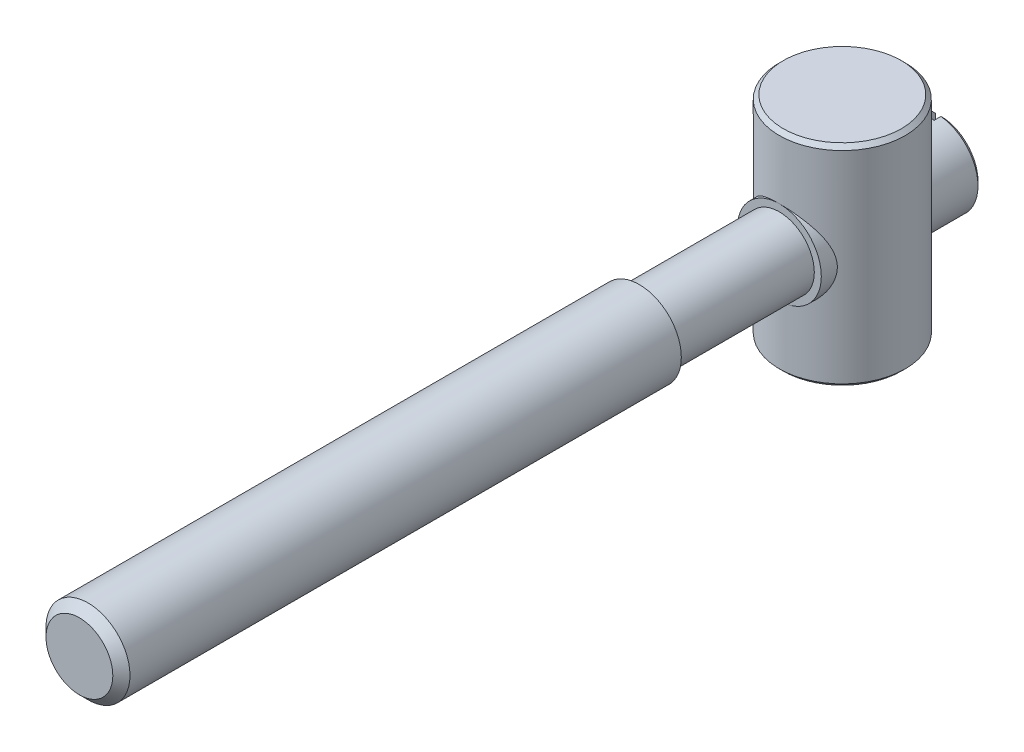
ISO-10303-21;
HEADER;
FILE_DESCRIPTION(('STEP AP214'),'2;1');
FILE_NAME('part.step','',(''),(''),'','','');
FILE_SCHEMA(('AUTOMOTIVE_DESIGN { 1 0 10303 214 1 1 1 1 }'));
ENDSEC;
DATA;
#1=APPLICATION_CONTEXT('core data for automotive mechanical design processes');
#2=APPLICATION_PROTOCOL_DEFINITION('international standard','automotive_design',2000,#1);
#3=PRODUCT_CONTEXT('',#1,'mechanical');
#4=PRODUCT('Part','Part','',(#3));
#5=PRODUCT_RELATED_PRODUCT_CATEGORY('part','',(#4));
#6=PRODUCT_DEFINITION_FORMATION('','',#4);
#7=PRODUCT_DEFINITION_CONTEXT('part definition',#1,'design');
#8=PRODUCT_DEFINITION('design','',#6,#7);
#9=PRODUCT_DEFINITION_SHAPE('','',#8);
#10=(LENGTH_UNIT() NAMED_UNIT(*) SI_UNIT(.MILLI.,.METRE.));
#11=(NAMED_UNIT(*) PLANE_ANGLE_UNIT() SI_UNIT($,.RADIAN.));
#12=(NAMED_UNIT(*) SI_UNIT($,.STERADIAN.) SOLID_ANGLE_UNIT());
#13=UNCERTAINTY_MEASURE_WITH_UNIT(LENGTH_MEASURE(1.E-05),#10,'distance_accuracy_value','');
#14=(GEOMETRIC_REPRESENTATION_CONTEXT(3) GLOBAL_UNCERTAINTY_ASSIGNED_CONTEXT((#13)) GLOBAL_UNIT_ASSIGNED_CONTEXT((#10,
#11,#12)) REPRESENTATION_CONTEXT('',''));
#15=CARTESIAN_POINT('',(0.,0.,0.));
#16=DIRECTION('',(0.,0.,1.));
#17=DIRECTION('',(1.,0.,0.));
#18=AXIS2_PLACEMENT_3D('',#15,#16,#17);
#19=CARTESIAN_POINT('',(0.,0.,19.8));
#20=DIRECTION('',(0.,0.,1.));
#21=DIRECTION('',(1.,0.,0.));
#22=AXIS2_PLACEMENT_3D('',#19,#20,#21);
#23=CYLINDRICAL_SURFACE('',#22,3.);
#24=CARTESIAN_POINT('',(0.,0.,-0.199999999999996));
#25=DIRECTION('',(0.,0.,1.));
#26=DIRECTION('',(1.,0.,0.));
#27=AXIS2_PLACEMENT_3D('',#24,#25,#26);
#28=CIRCLE('',#27,3.);
#29=CARTESIAN_POINT('',(3.,0.,-0.199999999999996));
#30=VERTEX_POINT('',#29);
#31=EDGE_CURVE('E241',#30,#30,#28,.T.);
#32=ORIENTED_EDGE('',*,*,#31,.T.);
#33=EDGE_LOOP('',(#32));
#34=FACE_BOUND('',#33,.T.);
#35=CARTESIAN_POINT('',(0.,0.,39.1865));
#36=DIRECTION('',(0.,0.,1.));
#37=DIRECTION('',(1.,0.,0.));
#38=AXIS2_PLACEMENT_3D('',#35,#36,#37);
#39=CIRCLE('',#38,3.);
#40=CARTESIAN_POINT('',(3.,0.,39.1865));
#41=VERTEX_POINT('',#40);
#42=EDGE_CURVE('E1013',#41,#41,#39,.T.);
#43=ORIENTED_EDGE('',*,*,#42,.F.);
#44=EDGE_LOOP('',(#43));
#45=FACE_BOUND('',#44,.T.);
#46=ADVANCED_FACE('F14',(#34,#45),#23,.T.);
#47=CARTESIAN_POINT('',(0.,0.,-0.199999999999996));
#48=DIRECTION('',(0.,0.,1.));
#49=DIRECTION('',(1.,0.,0.));
#50=AXIS2_PLACEMENT_3D('',#47,#48,#49);
#51=PLANE('',#50);
#52=ORIENTED_EDGE('',*,*,#31,.F.);
#53=EDGE_LOOP('',(#52));
#54=FACE_BOUND('',#53,.T.);
#55=CARTESIAN_POINT('',(0.,0.,-0.199999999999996));
#56=DIRECTION('',(0.,0.,1.));
#57=DIRECTION('',(1.,0.,0.));
#58=AXIS2_PLACEMENT_3D('',#55,#56,#57);
#59=CIRCLE('',#58,2.5);
#60=CARTESIAN_POINT('',(2.5,0.,-0.199999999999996));
#61=VERTEX_POINT('',#60);
#62=EDGE_CURVE('E238',#61,#61,#59,.T.);
#63=ORIENTED_EDGE('',*,*,#62,.T.);
#64=EDGE_LOOP('',(#63));
#65=FACE_BOUND('',#64,.T.);
#66=ADVANCED_FACE('F454',(#54,#65),#51,.F.);
#67=CARTESIAN_POINT('',(0.,0.,-0.199999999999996));
#68=DIRECTION('',(0.,0.,1.));
#69=DIRECTION('',(1.,0.,0.));
#70=AXIS2_PLACEMENT_3D('',#67,#68,#69);
#71=CYLINDRICAL_SURFACE('',#70,2.5);
#72=ORIENTED_EDGE('',*,*,#62,.F.);
#73=EDGE_LOOP('',(#72));
#74=FACE_BOUND('',#73,.T.);
#75=CARTESIAN_POINT('',(0.,0.,-10.2));
#76=DIRECTION('',(0.,0.,1.));
#77=DIRECTION('',(1.,0.,0.));
#78=AXIS2_PLACEMENT_3D('',#75,#76,#77);
#79=CIRCLE('',#78,2.5);
#80=CARTESIAN_POINT('',(2.5,0.,-10.2));
#81=VERTEX_POINT('',#80);
#82=EDGE_CURVE('E227',#81,#81,#79,.T.);
#83=ORIENTED_EDGE('',*,*,#82,.T.);
#84=EDGE_LOOP('',(#83));
#85=FACE_BOUND('',#84,.T.);
#86=ADVANCED_FACE('F450',(#74,#85),#71,.T.);
#87=CARTESIAN_POINT('',(0.,3.,-10.2));
#88=DIRECTION('',(0.,0.,-1.));
#89=DIRECTION('',(-1.,0.,0.));
#90=AXIS2_PLACEMENT_3D('',#87,#88,#89);
#91=PLANE('',#90);
#92=ORIENTED_EDGE('',*,*,#82,.F.);
#93=EDGE_LOOP('',(#92));
#94=FACE_BOUND('',#93,.T.);
#95=CARTESIAN_POINT('',(0.,0.,-10.2));
#96=DIRECTION('',(0.,0.,1.));
#97=DIRECTION('',(1.,0.,0.));
#98=AXIS2_PLACEMENT_3D('',#95,#96,#97);
#99=CIRCLE('',#98,3.);
#100=CARTESIAN_POINT('',(0.,3.,-10.2));
#101=VERTEX_POINT('',#100);
#102=CARTESIAN_POINT('',(0.,-3.,-10.2));
#103=VERTEX_POINT('',#102);
#104=EDGE_CURVE('E212',#101,#103,#99,.T.);
#105=ORIENTED_EDGE('',*,*,#104,.T.);
#106=EDGE_CURVE('E224',#103,#101,#99,.T.);
#107=ORIENTED_EDGE('',*,*,#106,.T.);
#108=EDGE_LOOP('',(#105,#107));
#109=FACE_BOUND('',#108,.T.);
#110=ADVANCED_FACE('F229',(#94,#109),#91,.F.);
#111=CARTESIAN_POINT('',(0.,0.,-10.2));
#112=DIRECTION('',(0.,0.,1.));
#113=DIRECTION('',(1.,0.,0.));
#114=AXIS2_PLACEMENT_3D('',#111,#112,#113);
#115=CYLINDRICAL_SURFACE('',#114,3.);
#116=CARTESIAN_POINT('',(3.,0.,-11.3458980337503));
#117=CARTESIAN_POINT('',(3.00000458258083,-0.0732569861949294,-11.3459058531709));
#118=CARTESIAN_POINT('',(2.99731244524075,-0.146481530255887,-11.3434885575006));
#119=CARTESIAN_POINT('',(2.98662615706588,-0.292242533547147,-11.3339762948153));
#120=CARTESIAN_POINT('',(2.97863116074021,-0.36477888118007,-11.3268805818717));
#121=CARTESIAN_POINT('',(2.94687150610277,-0.580557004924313,-11.2990027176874));
#122=CARTESIAN_POINT('',(2.91533243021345,-0.7218872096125,-11.2716303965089));
#123=CARTESIAN_POINT('',(2.83403844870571,-0.994135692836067,-11.2041558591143));
#124=CARTESIAN_POINT('',(2.78446038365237,-1.12514051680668,-11.1641777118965));
#125=CARTESIAN_POINT('',(2.66901051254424,-1.37678977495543,-11.0762374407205));
#126=CARTESIAN_POINT('',(2.60313532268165,-1.49743205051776,-11.0282736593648));
#127=CARTESIAN_POINT('',(2.44503375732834,-1.7454742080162,-10.9208087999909));
#128=CARTESIAN_POINT('',(2.35030173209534,-1.87100290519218,-10.8606739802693));
#129=CARTESIAN_POINT('',(2.14229810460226,-2.10599933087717,-10.7408295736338));
#130=CARTESIAN_POINT('',(2.02900845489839,-2.21545122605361,-10.6811204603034));
#131=CARTESIAN_POINT('',(1.76719317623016,-2.43098271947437,-10.5586587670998));
#132=CARTESIAN_POINT('',(1.61594159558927,-2.53429147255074,-10.4967124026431));
#133=CARTESIAN_POINT('',(1.37421346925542,-2.6683430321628,-10.4141112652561));
#134=CARTESIAN_POINT('',(1.29113866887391,-2.70954965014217,-10.3882918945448));
#135=CARTESIAN_POINT('',(1.12054013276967,-2.78442936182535,-10.3408485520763));
#136=CARTESIAN_POINT('',(1.03301977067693,-2.81810806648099,-10.3192214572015));
#137=CARTESIAN_POINT('',(0.864225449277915,-2.87404180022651,-10.2830195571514));
#138=CARTESIAN_POINT('',(0.78334499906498,-2.89715242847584,-10.2679269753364));
#139=CARTESIAN_POINT('',(0.619315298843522,-2.93658943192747,-10.2420480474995));
#140=CARTESIAN_POINT('',(0.536167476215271,-2.95291997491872,-10.2312590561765));
#141=CARTESIAN_POINT('',(0.368381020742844,-2.97850414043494,-10.2143123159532));
#142=CARTESIAN_POINT('',(0.283743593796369,-2.98776324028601,-10.2081509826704));
#143=CARTESIAN_POINT('',(0.113806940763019,-2.99905173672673,-10.2006336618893));
#144=CARTESIAN_POINT('',(0.0285078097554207,-3.00108215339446,-10.1992769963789));
#145=CARTESIAN_POINT('',(-0.201115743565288,-2.99672182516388,-10.2021880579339));
#146=CARTESIAN_POINT('',(-0.345332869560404,-2.98351119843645,-10.2110109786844));
#147=CARTESIAN_POINT('',(-0.628886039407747,-2.93686864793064,-10.2418723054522));
#148=CARTESIAN_POINT('',(-0.76822172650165,-2.90343524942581,-10.2639116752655));
#149=CARTESIAN_POINT('',(-1.03810942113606,-2.81820508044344,-10.319219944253));
#150=CARTESIAN_POINT('',(-1.16869392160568,-2.76648129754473,-10.352444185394));
#151=CARTESIAN_POINT('',(-1.41931574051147,-2.64666991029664,-10.4276830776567));
#152=CARTESIAN_POINT('',(-1.53935112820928,-2.57857931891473,-10.4696993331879));
#153=CARTESIAN_POINT('',(-1.78242579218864,-2.41803177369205,-10.5657292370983));
#154=CARTESIAN_POINT('',(-1.90378704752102,-2.32354868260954,-10.6205938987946));
#155=CARTESIAN_POINT('',(-2.12998228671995,-2.11815201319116,-10.7339909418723));
#156=CARTESIAN_POINT('',(-2.23479025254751,-2.00721309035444,-10.7925288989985));
#157=CARTESIAN_POINT('',(-2.44158347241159,-1.75205517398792,-10.9177493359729));
#158=CARTESIAN_POINT('',(-2.54060388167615,-1.60534337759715,-10.9842852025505));
#159=CARTESIAN_POINT('',(-2.71252313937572,-1.29373524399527,-11.1078658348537));
#160=CARTESIAN_POINT('',(-2.78546578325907,-1.12887000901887,-11.1649264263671));
#161=CARTESIAN_POINT('',(-2.88499086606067,-0.832921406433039,-11.2460569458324));
#162=CARTESIAN_POINT('',(-2.91886187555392,-0.705609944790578,-11.27489453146));
#163=CARTESIAN_POINT('',(-2.96969333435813,-0.445440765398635,-11.318864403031));
#164=CARTESIAN_POINT('',(-2.98668310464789,-0.312593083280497,-11.3340204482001));
#165=CARTESIAN_POINT('',(-3.0026910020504,-0.0443355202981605,-11.3482866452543));
#166=CARTESIAN_POINT('',(-3.0016309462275,0.091082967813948,-11.3473269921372));
#167=CARTESIAN_POINT('',(-2.98142444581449,0.359525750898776,-11.3293517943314));
#168=CARTESIAN_POINT('',(-2.96226334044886,0.492548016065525,-11.3123232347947));
#169=CARTESIAN_POINT('',(-2.90849716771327,0.746084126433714,-11.266080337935));
#170=CARTESIAN_POINT('',(-2.87469261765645,0.866891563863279,-11.2375021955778));
#171=CARTESIAN_POINT('',(-2.79334562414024,1.10118935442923,-11.1715506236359));
#172=CARTESIAN_POINT('',(-2.74579856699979,1.21467723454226,-11.1341742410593));
#173=CARTESIAN_POINT('',(-2.6274501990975,1.45530300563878,-11.0458277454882));
#174=CARTESIAN_POINT('',(-2.55390043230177,1.5806352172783,-10.9936337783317));
#175=CARTESIAN_POINT('',(-2.39029097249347,1.81862520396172,-10.8860622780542));
#176=CARTESIAN_POINT('',(-2.30021117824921,1.93126727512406,-10.8306809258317));
#177=CARTESIAN_POINT('',(-2.08314986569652,2.16594352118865,-10.7088648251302));
#178=CARTESIAN_POINT('',(-1.95240579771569,2.28465427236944,-10.642658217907));
#179=CARTESIAN_POINT('',(-1.6696492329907,2.49872502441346,-10.5183662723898));
#180=CARTESIAN_POINT('',(-1.51765571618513,2.59410565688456,-10.4602737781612));
#181=CARTESIAN_POINT('',(-1.226231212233,2.74183760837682,-10.3681376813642));
#182=CARTESIAN_POINT('',(-1.08999354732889,2.79893475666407,-10.3316181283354));
#183=CARTESIAN_POINT('',(-0.808135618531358,2.89291079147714,-10.2708193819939));
#184=CARTESIAN_POINT('',(-0.662523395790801,2.929806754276,-10.2465298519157));
#185=CARTESIAN_POINT('',(-0.365054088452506,2.98154544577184,-10.2123245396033));
#186=CARTESIAN_POINT('',(-0.213172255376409,2.99629001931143,-10.2024727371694));
#187=CARTESIAN_POINT('',(0.0912833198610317,3.00247177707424,-10.1983526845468));
#188=CARTESIAN_POINT('',(0.243856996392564,2.99391112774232,-10.2040829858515));
#189=CARTESIAN_POINT('',(0.533636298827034,2.95551076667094,-10.2295566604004));
#190=CARTESIAN_POINT('',(0.671152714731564,2.92726352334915,-10.2482508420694));
#191=CARTESIAN_POINT('',(0.939027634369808,2.8526429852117,-10.2969584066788));
#192=CARTESIAN_POINT('',(1.06938502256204,2.80626687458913,-10.3269735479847));
#193=CARTESIAN_POINT('',(1.32772094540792,2.69409194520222,-10.3981235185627));
#194=CARTESIAN_POINT('',(1.45512538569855,2.62732454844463,-10.4398012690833));
#195=CARTESIAN_POINT('',(1.6973289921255,2.47777402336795,-10.5303688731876));
#196=CARTESIAN_POINT('',(1.81212055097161,2.39498131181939,-10.5792630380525));
#197=CARTESIAN_POINT('',(2.04494134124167,2.20105668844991,-10.6891060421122));
#198=CARTESIAN_POINT('',(2.1606402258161,2.08751563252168,-10.7507413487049));
#199=CARTESIAN_POINT('',(2.37240030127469,1.84332951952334,-10.8741995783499));
#200=CARTESIAN_POINT('',(2.46844680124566,1.71267178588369,-10.9360226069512));
#201=CARTESIAN_POINT('',(2.63269891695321,1.44619919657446,-11.0492369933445));
#202=CARTESIAN_POINT('',(2.70247011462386,1.31153938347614,-11.1010644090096));
#203=CARTESIAN_POINT('',(2.82173662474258,1.0300712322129,-11.1937867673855));
#204=CARTESIAN_POINT('',(2.87127132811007,0.883287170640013,-11.2347028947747));
#205=CARTESIAN_POINT('',(2.93904512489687,0.613848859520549,-11.2921362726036));
#206=CARTESIAN_POINT('',(2.96178740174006,0.493057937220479,-11.3120514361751));
#207=CARTESIAN_POINT('',(2.99225476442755,0.248145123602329,-11.3389203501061));
#208=CARTESIAN_POINT('',(2.99999224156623,0.12402606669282,-11.345884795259));
#209=CARTESIAN_POINT('',(3.,0.,-11.3458980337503));
#210=B_SPLINE_CURVE_WITH_KNOTS('',3,(#116,#117,#118,#119,#120,#121,#122,#123,#124,#125,#126,
#127,#128,#129,#130,#131,#132,#133,#134,#135,#136,#137,#138,#139,#140,#141,#142,#143,#144,#145,
#146,#147,#148,#149,#150,#151,#152,#153,#154,#155,#156,#157,#158,#159,#160,#161,#162,#163,#164,
#165,#166,#167,#168,#169,#170,#171,#172,#173,#174,#175,#176,#177,#178,#179,#180,#181,#182,#183,
#184,#185,#186,#187,#188,#189,#190,#191,#192,#193,#194,#195,#196,#197,#198,#199,#200,#201,#202,
#203,#204,#205,#206,#207,#208,#209),.UNSPECIFIED.,.T.,.F.,(4,2,2,2,2,2,2,2,2,2,2,2,2,2,2,2,2,2,
2,2,2,2,2,2,2,2,2,2,2,2,2,2,2,2,2,2,2,2,2,2,2,2,2,2,2,2,4),(0.,0.219620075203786,
0.439275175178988,0.878823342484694,1.31417375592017,1.74961463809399,2.2528349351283,
2.75654755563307,3.33302024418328,3.62140722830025,3.90957854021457,4.16557735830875,
4.42141857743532,4.67706142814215,4.93266820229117,5.36561317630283,5.79858972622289,
6.22985763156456,6.6612043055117,7.14923304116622,7.63802137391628,8.20270070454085,
8.76642719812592,9.16941150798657,9.571694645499,9.97572071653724,10.3800743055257,
10.764666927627,11.1493888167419,11.6110086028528,12.0731935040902,12.636340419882,
13.1989875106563,13.653578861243,14.1077853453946,14.56399859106,15.0201694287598,
15.4431718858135,15.8662400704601,16.3137880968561,16.7616045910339,17.2798532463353,
17.7984879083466,18.2775320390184,18.755639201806,19.1277693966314,19.4995921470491),.UNSPECIFIED.);
#211=EDGE_CURVE('E215',#101,#103,#210,.T.);
#212=ORIENTED_EDGE('',*,*,#211,.F.);
#213=ORIENTED_EDGE('',*,*,#106,.F.);
#214=EDGE_LOOP('',(#212,#213));
#215=FACE_BOUND('',#214,.T.);
#216=ADVANCED_FACE('F225',(#215),#115,.T.);
#217=EDGE_CURVE('E208',#103,#101,#210,.T.);
#218=ORIENTED_EDGE('',*,*,#217,.F.);
#219=ORIENTED_EDGE('',*,*,#104,.F.);
#220=EDGE_LOOP('',(#218,#219));
#221=FACE_BOUND('',#220,.T.);
#222=ADVANCED_FACE('F210',(#221),#115,.T.);
#223=CARTESIAN_POINT('',(0.,0.,-21.3935));
#224=DIRECTION('',(0.,0.,1.));
#225=DIRECTION('',(1.,0.,0.));
#226=AXIS2_PLACEMENT_3D('',#223,#224,#225);
#227=CIRCLE('',#226,3.);
#228=CARTESIAN_POINT('',(-0.35,2.97951338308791,-21.3935));
#229=VERTEX_POINT('',#228);
#230=CARTESIAN_POINT('',(-0.35,-2.97951338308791,-21.3935));
#231=VERTEX_POINT('',#230);
#232=EDGE_CURVE('E232',#229,#231,#227,.T.);
#233=ORIENTED_EDGE('',*,*,#232,.T.);
#234=DIRECTION('',(0.,0.,1.));
#235=VECTOR('',#234,1.);
#236=CARTESIAN_POINT('',(-0.35,-2.97951338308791,-10.2));
#237=LINE('',#236,#235);
#238=CARTESIAN_POINT('',(-0.35,-2.97951338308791,-20.9));
#239=VERTEX_POINT('',#238);
#240=EDGE_CURVE('E351',#231,#239,#237,.T.);
#241=ORIENTED_EDGE('',*,*,#240,.T.);
#242=CARTESIAN_POINT('',(0.,0.,-20.9));
#243=DIRECTION('',(0.,0.,-1.));
#244=DIRECTION('',(-1.,0.,0.));
#245=AXIS2_PLACEMENT_3D('',#242,#243,#244);
#246=CIRCLE('',#245,3.);
#247=CARTESIAN_POINT('',(0.35,-2.97951338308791,-20.9));
#248=VERTEX_POINT('',#247);
#249=EDGE_CURVE('E346',#248,#239,#246,.T.);
#250=ORIENTED_EDGE('',*,*,#249,.F.);
#251=DIRECTION('',(0.,0.,1.));
#252=VECTOR('',#251,1.);
#253=CARTESIAN_POINT('',(0.35,-2.97951338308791,-10.2));
#254=LINE('',#253,#252);
#255=CARTESIAN_POINT('',(0.35,-2.97951338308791,-21.3935));
#256=VERTEX_POINT('',#255);
#257=EDGE_CURVE('E578',#256,#248,#254,.T.);
#258=ORIENTED_EDGE('',*,*,#257,.F.);
#259=CARTESIAN_POINT('',(0.35,2.97951338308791,-21.3935));
#260=VERTEX_POINT('',#259);
#261=EDGE_CURVE('E230',#256,#260,#227,.T.);
#262=ORIENTED_EDGE('',*,*,#261,.T.);
#263=DIRECTION('',(0.,0.,1.));
#264=VECTOR('',#263,1.);
#265=CARTESIAN_POINT('',(0.35,2.97951338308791,-10.2));
#266=LINE('',#265,#264);
#267=CARTESIAN_POINT('',(0.35,2.97951338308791,-20.9));
#268=VERTEX_POINT('',#267);
#269=EDGE_CURVE('E534',#268,#260,#266,.F.);
#270=ORIENTED_EDGE('',*,*,#269,.F.);
#271=CARTESIAN_POINT('',(-0.35,2.97951338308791,-20.9));
#272=VERTEX_POINT('',#271);
#273=EDGE_CURVE('E307',#272,#268,#246,.T.);
#274=ORIENTED_EDGE('',*,*,#273,.F.);
#275=DIRECTION('',(0.,0.,1.));
#276=VECTOR('',#275,1.);
#277=CARTESIAN_POINT('',(-0.35,2.97951338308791,-10.2));
#278=LINE('',#277,#276);
#279=EDGE_CURVE('E357',#272,#229,#278,.F.);
#280=ORIENTED_EDGE('',*,*,#279,.T.);
#281=EDGE_LOOP('',(#233,#241,#250,#258,#262,#270,#274,#280));
#282=FACE_BOUND('',#281,.T.);
#283=CARTESIAN_POINT('',(3.,0.,-18.0541019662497));
#284=CARTESIAN_POINT('',(3.00000458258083,0.07325698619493,-18.0540941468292));
#285=CARTESIAN_POINT('',(2.99731244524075,0.146481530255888,-18.0565114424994));
#286=CARTESIAN_POINT('',(2.98662615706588,0.29224253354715,-18.0660237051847));
#287=CARTESIAN_POINT('',(2.97863116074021,0.364778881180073,-18.0731194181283));
#288=CARTESIAN_POINT('',(2.94687150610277,0.580557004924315,-18.1009972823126));
#289=CARTESIAN_POINT('',(2.91533243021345,0.7218872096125,-18.1283696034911));
#290=CARTESIAN_POINT('',(2.83403844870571,0.994135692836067,-18.1958441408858));
#291=CARTESIAN_POINT('',(2.78446038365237,1.12514051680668,-18.2358222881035));
#292=CARTESIAN_POINT('',(2.66901051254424,1.37678977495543,-18.3237625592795));
#293=CARTESIAN_POINT('',(2.60313532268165,1.49743205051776,-18.3717263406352));
#294=CARTESIAN_POINT('',(2.44503375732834,1.7454742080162,-18.4791912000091));
#295=CARTESIAN_POINT('',(2.35030173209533,1.87100290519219,-18.5393260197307));
#296=CARTESIAN_POINT('',(2.14229810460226,2.10599933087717,-18.6591704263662));
#297=CARTESIAN_POINT('',(2.02900845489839,2.21545122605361,-18.7188795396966));
#298=CARTESIAN_POINT('',(1.76719317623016,2.43098271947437,-18.8413412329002));
#299=CARTESIAN_POINT('',(1.61594159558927,2.53429147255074,-18.9032875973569));
#300=CARTESIAN_POINT('',(1.37421346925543,2.6683430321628,-18.9858887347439));
#301=CARTESIAN_POINT('',(1.29113866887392,2.70954965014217,-19.0117081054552));
#302=CARTESIAN_POINT('',(1.12054013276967,2.78442936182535,-19.0591514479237));
#303=CARTESIAN_POINT('',(1.03301977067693,2.81810806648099,-19.0807785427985));
#304=CARTESIAN_POINT('',(0.864225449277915,2.87404180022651,-19.1169804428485));
#305=CARTESIAN_POINT('',(0.783344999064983,2.89715242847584,-19.1320730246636));
#306=CARTESIAN_POINT('',(0.619315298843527,2.93658943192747,-19.1579519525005));
#307=CARTESIAN_POINT('',(0.536167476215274,2.95291997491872,-19.1687409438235));
#308=CARTESIAN_POINT('',(0.368381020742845,2.97850414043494,-19.1856876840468));
#309=CARTESIAN_POINT('',(0.283743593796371,2.98776324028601,-19.1918490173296));
#310=CARTESIAN_POINT('',(0.11380694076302,2.99905173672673,-19.1993663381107));
#311=CARTESIAN_POINT('',(0.0285078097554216,3.00108215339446,-19.2007230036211));
#312=CARTESIAN_POINT('',(-0.201115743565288,2.99672182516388,-19.1978119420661));
#313=CARTESIAN_POINT('',(-0.345332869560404,2.98351119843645,-19.1889890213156));
#314=CARTESIAN_POINT('',(-0.628886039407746,2.93686864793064,-19.1581276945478));
#315=CARTESIAN_POINT('',(-0.768221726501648,2.90343524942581,-19.1360883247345));
#316=CARTESIAN_POINT('',(-1.03810942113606,2.81820508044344,-19.080780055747));
#317=CARTESIAN_POINT('',(-1.16869392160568,2.76648129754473,-19.047555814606));
#318=CARTESIAN_POINT('',(-1.41931574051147,2.64666991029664,-18.9723169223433));
#319=CARTESIAN_POINT('',(-1.53935112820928,2.57857931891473,-18.9303006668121));
#320=CARTESIAN_POINT('',(-1.78242579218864,2.41803177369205,-18.8342707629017));
#321=CARTESIAN_POINT('',(-1.90378704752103,2.32354868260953,-18.7794061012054));
#322=CARTESIAN_POINT('',(-2.12998228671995,2.11815201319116,-18.6660090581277));
#323=CARTESIAN_POINT('',(-2.23479025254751,2.00721309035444,-18.6074711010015));
#324=CARTESIAN_POINT('',(-2.44158347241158,1.75205517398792,-18.4822506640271));
#325=CARTESIAN_POINT('',(-2.54060388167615,1.60534337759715,-18.4157147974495));
#326=CARTESIAN_POINT('',(-2.71252313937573,1.29373524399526,-18.2921341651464));
#327=CARTESIAN_POINT('',(-2.78546578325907,1.12887000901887,-18.2350735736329));
#328=CARTESIAN_POINT('',(-2.88499086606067,0.832921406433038,-18.1539430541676));
#329=CARTESIAN_POINT('',(-2.91886187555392,0.705609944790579,-18.12510546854));
#330=CARTESIAN_POINT('',(-2.96969333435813,0.445440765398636,-18.081135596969));
#331=CARTESIAN_POINT('',(-2.98668310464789,0.312593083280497,-18.0659795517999));
#332=CARTESIAN_POINT('',(-3.0026910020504,0.0443355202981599,-18.0517133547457));
#333=CARTESIAN_POINT('',(-3.0016309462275,-0.0910829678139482,-18.0526730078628));
#334=CARTESIAN_POINT('',(-2.98142444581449,-0.359525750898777,-18.0706482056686));
#335=CARTESIAN_POINT('',(-2.96226334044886,-0.492548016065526,-18.0876767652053));
#336=CARTESIAN_POINT('',(-2.90849716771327,-0.746084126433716,-18.133919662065));
#337=CARTESIAN_POINT('',(-2.87469261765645,-0.86689156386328,-18.1624978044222));
#338=CARTESIAN_POINT('',(-2.79334562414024,-1.10118935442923,-18.2284493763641));
#339=CARTESIAN_POINT('',(-2.74579856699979,-1.21467723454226,-18.2658257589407));
#340=CARTESIAN_POINT('',(-2.6274501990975,-1.45530300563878,-18.3541722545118));
#341=CARTESIAN_POINT('',(-2.55390043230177,-1.5806352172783,-18.4063662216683));
#342=CARTESIAN_POINT('',(-2.39029097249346,-1.81862520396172,-18.5139377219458));
#343=CARTESIAN_POINT('',(-2.30021117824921,-1.93126727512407,-18.5693190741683));
#344=CARTESIAN_POINT('',(-2.08314986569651,-2.16594352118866,-18.6911351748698));
#345=CARTESIAN_POINT('',(-1.95240579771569,-2.28465427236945,-18.757341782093));
#346=CARTESIAN_POINT('',(-1.6696492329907,-2.49872502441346,-18.8816337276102));
#347=CARTESIAN_POINT('',(-1.51765571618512,-2.59410565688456,-18.9397262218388));
#348=CARTESIAN_POINT('',(-1.226231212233,-2.74183760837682,-19.0318623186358));
#349=CARTESIAN_POINT('',(-1.08999354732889,-2.79893475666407,-19.0683818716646));
#350=CARTESIAN_POINT('',(-0.808135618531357,-2.89291079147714,-19.1291806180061));
#351=CARTESIAN_POINT('',(-0.6625233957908,-2.929806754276,-19.1534701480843));
#352=CARTESIAN_POINT('',(-0.365054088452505,-2.98154544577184,-19.1876754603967));
#353=CARTESIAN_POINT('',(-0.213172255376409,-2.99629001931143,-19.1975272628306));
#354=CARTESIAN_POINT('',(0.0912833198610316,-3.00247177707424,-19.2016473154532));
#355=CARTESIAN_POINT('',(0.243856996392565,-2.99391112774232,-19.1959170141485));
#356=CARTESIAN_POINT('',(0.533636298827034,-2.95551076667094,-19.1704433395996));
#357=CARTESIAN_POINT('',(0.671152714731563,-2.92726352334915,-19.1517491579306));
#358=CARTESIAN_POINT('',(0.939027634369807,-2.8526429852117,-19.1030415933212));
#359=CARTESIAN_POINT('',(1.06938502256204,-2.80626687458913,-19.0730264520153));
#360=CARTESIAN_POINT('',(1.32772094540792,-2.69409194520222,-19.0018764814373));
#361=CARTESIAN_POINT('',(1.45512538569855,-2.62732454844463,-18.9601987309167));
#362=CARTESIAN_POINT('',(1.69732899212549,-2.47777402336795,-18.8696311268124));
#363=CARTESIAN_POINT('',(1.81212055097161,-2.39498131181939,-18.8207369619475));
#364=CARTESIAN_POINT('',(2.04494134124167,-2.20105668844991,-18.7108939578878));
#365=CARTESIAN_POINT('',(2.1606402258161,-2.08751563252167,-18.6492586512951));
#366=CARTESIAN_POINT('',(2.37240030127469,-1.84332951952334,-18.5258004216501));
#367=CARTESIAN_POINT('',(2.46844680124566,-1.71267178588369,-18.4639773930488));
#368=CARTESIAN_POINT('',(2.63269891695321,-1.44619919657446,-18.3507630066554));
#369=CARTESIAN_POINT('',(2.70247011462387,-1.31153938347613,-18.2989355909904));
#370=CARTESIAN_POINT('',(2.82173662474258,-1.03007123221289,-18.2062132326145));
#371=CARTESIAN_POINT('',(2.87127132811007,-0.883287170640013,-18.1652971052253));
#372=CARTESIAN_POINT('',(2.93904512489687,-0.613848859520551,-18.1078637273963));
#373=CARTESIAN_POINT('',(2.96178740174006,-0.493057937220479,-18.0879485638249));
#374=CARTESIAN_POINT('',(2.99225476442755,-0.248145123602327,-18.0610796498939));
#375=CARTESIAN_POINT('',(2.99999224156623,-0.12402606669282,-18.054115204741));
#376=CARTESIAN_POINT('',(3.,0.,-18.0541019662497));
#377=B_SPLINE_CURVE_WITH_KNOTS('',3,(#283,#284,#285,#286,#287,#288,#289,#290,#291,#292,#293,
#294,#295,#296,#297,#298,#299,#300,#301,#302,#303,#304,#305,#306,#307,#308,#309,#310,#311,#312,
#313,#314,#315,#316,#317,#318,#319,#320,#321,#322,#323,#324,#325,#326,#327,#328,#329,#330,#331,
#332,#333,#334,#335,#336,#337,#338,#339,#340,#341,#342,#343,#344,#345,#346,#347,#348,#349,#350,
#351,#352,#353,#354,#355,#356,#357,#358,#359,#360,#361,#362,#363,#364,#365,#366,#367,#368,#369,
#370,#371,#372,#373,#374,#375,#376),.UNSPECIFIED.,.T.,.F.,(4,2,2,2,2,2,2,2,2,2,2,2,2,2,2,2,2,2,
2,2,2,2,2,2,2,2,2,2,2,2,2,2,2,2,2,2,2,2,2,2,2,2,2,2,2,2,4),(0.,0.219620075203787,
0.439275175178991,0.878823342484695,1.31417375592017,1.74961463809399,2.2528349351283,
2.75654755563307,3.33302024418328,3.62140722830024,3.90957854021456,4.16557735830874,
4.42141857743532,4.67706142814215,4.93266820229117,5.36561317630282,5.79858972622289,
6.22985763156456,6.6612043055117,7.14923304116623,7.63802137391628,8.20270070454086,
8.76642719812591,9.16941150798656,9.571694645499,9.97572071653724,10.3800743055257,
10.764666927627,11.1493888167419,11.6110086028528,12.0731935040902,12.636340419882,
13.1989875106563,13.653578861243,14.1077853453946,14.56399859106,15.0201694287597,
15.4431718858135,15.8662400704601,16.3137880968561,16.7616045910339,17.2798532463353,
17.7984879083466,18.2775320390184,18.755639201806,19.1277693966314,19.4995921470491),.UNSPECIFIED.);
#378=CARTESIAN_POINT('',(3.,0.,-18.0541019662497));
#379=VERTEX_POINT('',#378);
#380=EDGE_CURVE('E216',#379,#379,#377,.T.);
#381=ORIENTED_EDGE('',*,*,#380,.F.);
#382=EDGE_LOOP('',(#381));
#383=FACE_BOUND('',#382,.T.);
#384=ADVANCED_FACE('F441',(#282,#383),#115,.T.);
#385=CARTESIAN_POINT('',(0.362499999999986,-1.5223709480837,-20.1));
#386=DIRECTION('',(0.,0.,-1.));
#387=DIRECTION('',(-1.,0.,0.));
#388=AXIS2_PLACEMENT_3D('',#385,#386,#387);
#389=PLANE('',#388);
#390=CARTESIAN_POINT('',(-1.54932383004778,-0.894502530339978,-20.1));
#391=DIRECTION('',(0.,0.,-1.));
#392=DIRECTION('',(0.,1.,0.));
#393=AXIS2_PLACEMENT_3D('',#390,#391,#392);
#394=CIRCLE('',#393,0.7);
#395=CARTESIAN_POINT('',(-0.900526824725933,-0.631705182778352,-20.1));
#396=VERTEX_POINT('',#395);
#397=CARTESIAN_POINT('',(-0.908183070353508,-1.17546253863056,-20.1));
#398=VERTEX_POINT('',#397);
#399=EDGE_CURVE('E337',#396,#398,#394,.T.);
#400=ORIENTED_EDGE('',*,*,#399,.F.);
#401=CARTESIAN_POINT('',(0.,0.,-20.1));
#402=DIRECTION('',(0.,0.,-1.));
#403=DIRECTION('',(-1.,0.,0.));
#404=AXIS2_PLACEMENT_3D('',#401,#402,#403);
#405=CIRCLE('',#404,1.10000000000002);
#406=CARTESIAN_POINT('',(-0.096809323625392,-1.09573169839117,-20.1));
#407=VERTEX_POINT('',#406);
#408=EDGE_CURVE('E223',#396,#407,#405,.F.);
#409=ORIENTED_EDGE('',*,*,#408,.T.);
#410=CARTESIAN_POINT('',(0.,-1.78900506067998,-20.1));
#411=DIRECTION('',(0.,0.,-1.));
#412=DIRECTION('',(0.,1.,0.));
#413=AXIS2_PLACEMENT_3D('',#410,#411,#412);
#414=CIRCLE('',#413,0.7);
#415=CARTESIAN_POINT('',(-0.563888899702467,-1.3742409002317,-20.1));
#416=VERTEX_POINT('',#415);
#417=EDGE_CURVE('E340',#416,#407,#414,.T.);
#418=ORIENTED_EDGE('',*,*,#417,.F.);
#419=CARTESIAN_POINT('',(-0.725000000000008,-1.25573683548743,-20.1));
#420=DIRECTION('',(0.,0.,-1.));
#421=DIRECTION('',(0.,1.,0.));
#422=AXIS2_PLACEMENT_3D('',#419,#420,#421);
#423=CIRCLE('',#422,0.2);
#424=EDGE_CURVE('E338',#416,#398,#423,.T.);
#425=ORIENTED_EDGE('',*,*,#424,.T.);
#426=EDGE_LOOP('',(#400,#409,#418,#425));
#427=FACE_BOUND('',#426,.T.);
#428=ADVANCED_FACE('F445',(#427),#389,.T.);
#429=CARTESIAN_POINT('',(0.0968093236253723,-1.09573169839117,-20.1));
#430=VERTEX_POINT('',#429);
#431=CARTESIAN_POINT('',(0.563888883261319,-1.37424087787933,-20.1));
#432=VERTEX_POINT('',#431);
#433=EDGE_CURVE('E344',#430,#432,#414,.T.);
#434=ORIENTED_EDGE('',*,*,#433,.F.);
#435=CARTESIAN_POINT('',(0.900526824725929,-0.631705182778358,-20.1));
#436=VERTEX_POINT('',#435);
#437=EDGE_CURVE('E640',#430,#436,#405,.F.);
#438=ORIENTED_EDGE('',*,*,#437,.T.);
#439=CARTESIAN_POINT('',(1.54932383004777,-0.894502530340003,-20.1));
#440=DIRECTION('',(0.,0.,-1.));
#441=DIRECTION('',(0.,1.,0.));
#442=AXIS2_PLACEMENT_3D('',#439,#440,#441);
#443=CIRCLE('',#442,0.7);
#444=CARTESIAN_POINT('',(0.908183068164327,-1.17546253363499,-20.1));
#445=VERTEX_POINT('',#444);
#446=EDGE_CURVE('E274',#445,#436,#443,.T.);
#447=ORIENTED_EDGE('',*,*,#446,.F.);
#448=CARTESIAN_POINT('',(0.724999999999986,-1.25573683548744,-20.1));
#449=DIRECTION('',(0.,0.,-1.));
#450=DIRECTION('',(0.,1.,0.));
#451=AXIS2_PLACEMENT_3D('',#448,#449,#450);
#452=CIRCLE('',#451,0.2);
#453=EDGE_CURVE('E279',#445,#432,#452,.T.);
#454=ORIENTED_EDGE('',*,*,#453,.T.);
#455=EDGE_LOOP('',(#434,#438,#447,#454));
#456=FACE_BOUND('',#455,.T.);
#457=ADVANCED_FACE('F638',(#456),#389,.T.);
#458=CARTESIAN_POINT('',(0.997336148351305,-0.464026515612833,-20.1));
#459=VERTEX_POINT('',#458);
#460=CARTESIAN_POINT('',(1.47207195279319,-0.198778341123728,-20.1));
#461=VERTEX_POINT('',#460);
#462=EDGE_CURVE('E311',#459,#461,#443,.T.);
#463=ORIENTED_EDGE('',*,*,#462,.F.);
#464=CARTESIAN_POINT('',(0.997336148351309,0.464026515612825,-20.1));
#465=VERTEX_POINT('',#464);
#466=EDGE_CURVE('E681',#459,#465,#405,.F.);
#467=ORIENTED_EDGE('',*,*,#466,.T.);
#468=CARTESIAN_POINT('',(1.54932383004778,0.894502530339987,-20.1));
#469=DIRECTION('',(0.,0.,-1.));
#470=DIRECTION('',(0.,1.,0.));
#471=AXIS2_PLACEMENT_3D('',#468,#469,#470);
#472=CIRCLE('',#471,0.7);
#473=CARTESIAN_POINT('',(1.47207196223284,0.198778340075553,-20.1));
#474=VERTEX_POINT('',#473);
#475=EDGE_CURVE('E314',#474,#465,#472,.T.);
#476=ORIENTED_EDGE('',*,*,#475,.F.);
#477=CARTESIAN_POINT('',(1.45,0.,-20.1));
#478=DIRECTION('',(0.,0.,-1.));
#479=DIRECTION('',(0.,1.,0.));
#480=AXIS2_PLACEMENT_3D('',#477,#478,#479);
#481=CIRCLE('',#480,0.2);
#482=EDGE_CURVE('E312',#474,#461,#481,.T.);
#483=ORIENTED_EDGE('',*,*,#482,.T.);
#484=EDGE_LOOP('',(#463,#467,#476,#483));
#485=FACE_BOUND('',#484,.T.);
#486=ADVANCED_FACE('F692',(#485),#389,.T.);
#487=CARTESIAN_POINT('',(0.900526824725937,0.631705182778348,-20.1));
#488=VERTEX_POINT('',#487);
#489=CARTESIAN_POINT('',(0.908183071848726,1.17546254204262,-20.1));
#490=VERTEX_POINT('',#489);
#491=EDGE_CURVE('E318',#488,#490,#472,.T.);
#492=ORIENTED_EDGE('',*,*,#491,.F.);
#493=CARTESIAN_POINT('',(0.0968093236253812,1.09573169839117,-20.1));
#494=VERTEX_POINT('',#493);
#495=EDGE_CURVE('E676',#488,#494,#405,.F.);
#496=ORIENTED_EDGE('',*,*,#495,.T.);
#497=CARTESIAN_POINT('',(0.,1.78900506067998,-20.1));
#498=DIRECTION('',(0.,0.,-1.));
#499=DIRECTION('',(0.,1.,0.));
#500=AXIS2_PLACEMENT_3D('',#497,#498,#499);
#501=CIRCLE('',#500,0.7);
#502=CARTESIAN_POINT('',(0.563888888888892,1.37424088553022,-20.1));
#503=VERTEX_POINT('',#502);
#504=EDGE_CURVE('E321',#503,#494,#501,.T.);
#505=ORIENTED_EDGE('',*,*,#504,.F.);
#506=CARTESIAN_POINT('',(0.725,1.25573683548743,-20.1));
#507=DIRECTION('',(0.,0.,-1.));
#508=DIRECTION('',(0.,1.,0.));
#509=AXIS2_PLACEMENT_3D('',#506,#507,#508);
#510=CIRCLE('',#509,0.2);
#511=EDGE_CURVE('E319',#503,#490,#510,.T.);
#512=ORIENTED_EDGE('',*,*,#511,.T.);
#513=EDGE_LOOP('',(#492,#496,#505,#512));
#514=FACE_BOUND('',#513,.T.);
#515=ADVANCED_FACE('F677',(#514),#389,.T.);
#516=CARTESIAN_POINT('',(-0.0968093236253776,1.09573169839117,-20.1));
#517=VERTEX_POINT('',#516);
#518=CARTESIAN_POINT('',(-0.563888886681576,1.37424088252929,-20.1));
#519=VERTEX_POINT('',#518);
#520=EDGE_CURVE('E323',#517,#519,#501,.T.);
#521=ORIENTED_EDGE('',*,*,#520,.F.);
#522=CARTESIAN_POINT('',(-0.900526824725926,0.631705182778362,-20.1));
#523=VERTEX_POINT('',#522);
#524=EDGE_CURVE('E601',#517,#523,#405,.F.);
#525=ORIENTED_EDGE('',*,*,#524,.T.);
#526=CARTESIAN_POINT('',(-1.54932383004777,0.894502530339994,-20.1));
#527=DIRECTION('',(0.,0.,-1.));
#528=DIRECTION('',(0.,1.,0.));
#529=AXIS2_PLACEMENT_3D('',#526,#527,#528);
#530=CIRCLE('',#529,0.7);
#531=CARTESIAN_POINT('',(-0.908183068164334,1.17546253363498,-20.1));
#532=VERTEX_POINT('',#531);
#533=EDGE_CURVE('E326',#532,#523,#530,.T.);
#534=ORIENTED_EDGE('',*,*,#533,.F.);
#535=CARTESIAN_POINT('',(-0.725,1.25573683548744,-20.1));
#536=DIRECTION('',(0.,0.,-1.));
#537=DIRECTION('',(0.,1.,0.));
#538=AXIS2_PLACEMENT_3D('',#535,#536,#537);
#539=CIRCLE('',#538,0.2);
#540=EDGE_CURVE('E324',#532,#519,#539,.T.);
#541=ORIENTED_EDGE('',*,*,#540,.T.);
#542=EDGE_LOOP('',(#521,#525,#534,#541));
#543=FACE_BOUND('',#542,.T.);
#544=ADVANCED_FACE('F513',(#543),#389,.T.);
#545=CARTESIAN_POINT('',(0.,0.,-21.7));
#546=DIRECTION('',(0.,0.,1.));
#547=DIRECTION('',(1.,0.,0.));
#548=AXIS2_PLACEMENT_3D('',#545,#546,#547);
#549=PLANE('',#548);
#550=DIRECTION('',(0.,-1.,0.));
#551=VECTOR('',#550,1.);
#552=CARTESIAN_POINT('',(0.35,0.,-21.7));
#553=LINE('',#552,#551);
#554=CARTESIAN_POINT('',(0.35,2.67066326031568,-21.7));
#555=VERTEX_POINT('',#554);
#556=CARTESIAN_POINT('',(0.35,1.18278727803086,-21.7));
#557=VERTEX_POINT('',#556);
#558=EDGE_CURVE('E547',#555,#557,#553,.T.);
#559=ORIENTED_EDGE('',*,*,#558,.F.);
#560=CARTESIAN_POINT('',(0.,0.,-21.7));
#561=DIRECTION('',(0.,0.,1.));
#562=DIRECTION('',(1.,0.,0.));
#563=AXIS2_PLACEMENT_3D('',#560,#561,#562);
#564=CIRCLE('',#563,2.6935);
#565=CARTESIAN_POINT('',(0.35,-2.67066326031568,-21.7));
#566=VERTEX_POINT('',#565);
#567=EDGE_CURVE('E577',#566,#555,#564,.T.);
#568=ORIENTED_EDGE('',*,*,#567,.F.);
#569=CARTESIAN_POINT('',(0.35,-1.18278727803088,-21.7));
#570=VERTEX_POINT('',#569);
#571=EDGE_CURVE('E551',#570,#566,#553,.T.);
#572=ORIENTED_EDGE('',*,*,#571,.F.);
#573=CARTESIAN_POINT('',(0.,-1.78900506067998,-21.7));
#574=DIRECTION('',(0.,0.,-1.));
#575=DIRECTION('',(0.,1.,0.));
#576=AXIS2_PLACEMENT_3D('',#573,#574,#575);
#577=CIRCLE('',#576,0.7);
#578=CARTESIAN_POINT('',(0.563888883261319,-1.37424087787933,-21.7));
#579=VERTEX_POINT('',#578);
#580=EDGE_CURVE('E304',#570,#579,#577,.T.);
#581=ORIENTED_EDGE('',*,*,#580,.T.);
#582=CARTESIAN_POINT('',(0.724999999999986,-1.25573683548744,-21.7));
#583=DIRECTION('',(0.,0.,-1.));
#584=DIRECTION('',(0.,1.,0.));
#585=AXIS2_PLACEMENT_3D('',#582,#583,#584);
#586=CIRCLE('',#585,0.2);
#587=CARTESIAN_POINT('',(0.908183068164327,-1.17546253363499,-21.7));
#588=VERTEX_POINT('',#587);
#589=EDGE_CURVE('E305',#588,#579,#586,.T.);
#590=ORIENTED_EDGE('',*,*,#589,.F.);
#591=CARTESIAN_POINT('',(1.54932383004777,-0.894502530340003,-21.7));
#592=DIRECTION('',(0.,0.,-1.));
#593=DIRECTION('',(0.,1.,0.));
#594=AXIS2_PLACEMENT_3D('',#591,#592,#593);
#595=CIRCLE('',#594,0.7);
#596=CARTESIAN_POINT('',(1.47207195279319,-0.198778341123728,-21.7));
#597=VERTEX_POINT('',#596);
#598=EDGE_CURVE('E275',#588,#597,#595,.T.);
#599=ORIENTED_EDGE('',*,*,#598,.T.);
#600=CARTESIAN_POINT('',(1.45,0.,-21.7));
#601=DIRECTION('',(0.,0.,-1.));
#602=DIRECTION('',(0.,1.,0.));
#603=AXIS2_PLACEMENT_3D('',#600,#601,#602);
#604=CIRCLE('',#603,0.2);
#605=CARTESIAN_POINT('',(1.47207196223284,0.198778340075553,-21.7));
#606=VERTEX_POINT('',#605);
#607=EDGE_CURVE('E278',#606,#597,#604,.T.);
#608=ORIENTED_EDGE('',*,*,#607,.F.);
#609=CARTESIAN_POINT('',(1.54932383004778,0.894502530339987,-21.7));
#610=DIRECTION('',(0.,0.,-1.));
#611=DIRECTION('',(0.,1.,0.));
#612=AXIS2_PLACEMENT_3D('',#609,#610,#611);
#613=CIRCLE('',#612,0.7);
#614=CARTESIAN_POINT('',(0.908183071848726,1.17546254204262,-21.7));
#615=VERTEX_POINT('',#614);
#616=EDGE_CURVE('E281',#606,#615,#613,.T.);
#617=ORIENTED_EDGE('',*,*,#616,.T.);
#618=CARTESIAN_POINT('',(0.725,1.25573683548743,-21.7));
#619=DIRECTION('',(0.,0.,-1.));
#620=DIRECTION('',(0.,1.,0.));
#621=AXIS2_PLACEMENT_3D('',#618,#619,#620);
#622=CIRCLE('',#621,0.2);
#623=CARTESIAN_POINT('',(0.563888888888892,1.37424088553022,-21.7));
#624=VERTEX_POINT('',#623);
#625=EDGE_CURVE('E284',#624,#615,#622,.T.);
#626=ORIENTED_EDGE('',*,*,#625,.F.);
#627=CARTESIAN_POINT('',(0.,1.78900506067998,-21.7));
#628=DIRECTION('',(0.,0.,-1.));
#629=DIRECTION('',(0.,1.,0.));
#630=AXIS2_PLACEMENT_3D('',#627,#628,#629);
#631=CIRCLE('',#630,0.7);
#632=EDGE_CURVE('E286',#624,#557,#631,.T.);
#633=ORIENTED_EDGE('',*,*,#632,.T.);
#634=EDGE_LOOP('',(#559,#568,#572,#581,#590,#599,#608,#617,#626,#633));
#635=FACE_BOUND('',#634,.T.);
#636=ADVANCED_FACE('F574',(#635),#549,.F.);
#637=CARTESIAN_POINT('',(0.,0.,-21.7));
#638=DIRECTION('',(0.,0.,1.));
#639=DIRECTION('',(1.,0.,0.));
#640=AXIS2_PLACEMENT_3D('',#637,#638,#639);
#641=CONICAL_SURFACE('',#640,2.6935,0.785398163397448);
#642=CARTESIAN_POINT('',(0.35,2.98021819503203,-21.3928));
#643=CARTESIAN_POINT('',(0.35,2.90084818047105,-21.4716266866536));
#644=CARTESIAN_POINT('',(0.35,2.82145826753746,-21.5504333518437));
#645=CARTESIAN_POINT('',(0.35,2.66260716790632,-21.7080068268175));
#646=CARTESIAN_POINT('',(0.35,2.58314597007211,-21.7867736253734));
#647=CARTESIAN_POINT('',(0.35,2.42382350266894,-21.9445618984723));
#648=CARTESIAN_POINT('',(0.35,2.34396193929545,-22.0235830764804));
#649=CARTESIAN_POINT('',(0.35,2.18415716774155,-22.1815109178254));
#650=CARTESIAN_POINT('',(0.35,2.10421397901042,-22.2604176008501));
#651=CARTESIAN_POINT('',(0.35,1.89506425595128,-22.466515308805));
#652=CARTESIAN_POINT('',(0.35,1.76575322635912,-22.5936005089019));
#653=CARTESIAN_POINT('',(0.35,1.57125915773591,-22.7837869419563));
#654=CARTESIAN_POINT('',(0.35,1.50631532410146,-22.8471326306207));
#655=CARTESIAN_POINT('',(0.35,1.37619797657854,-22.9735762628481));
#656=CARTESIAN_POINT('',(0.35,1.31102448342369,-23.0366742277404));
#657=CARTESIAN_POINT('',(0.35,1.18058541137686,-23.1622531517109));
#658=CARTESIAN_POINT('',(0.35,1.1153212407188,-23.2247355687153));
#659=CARTESIAN_POINT('',(0.35,0.984202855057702,-23.3491215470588));
#660=CARTESIAN_POINT('',(0.35,0.918348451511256,-23.4110249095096));
#661=CARTESIAN_POINT('',(0.35,0.785758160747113,-23.5336994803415));
#662=CARTESIAN_POINT('',(0.35,0.719023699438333,-23.5944722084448));
#663=CARTESIAN_POINT('',(0.35,0.617447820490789,-23.6839263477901));
#664=CARTESIAN_POINT('',(0.35,0.583352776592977,-23.713452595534));
#665=CARTESIAN_POINT('',(0.35,0.514402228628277,-23.7716003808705));
#666=CARTESIAN_POINT('',(0.35,0.479546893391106,-23.8002221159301));
#667=CARTESIAN_POINT('',(0.35,0.430866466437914,-23.838449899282));
#668=CARTESIAN_POINT('',(0.35,0.417565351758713,-23.8487213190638));
#669=CARTESIAN_POINT('',(0.35,0.390754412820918,-23.8689888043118));
#670=CARTESIAN_POINT('',(0.35,0.377244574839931,-23.8789848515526));
#671=CARTESIAN_POINT('',(0.35,0.336268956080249,-23.9085114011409));
#672=CARTESIAN_POINT('',(0.35,0.308422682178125,-23.9275278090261));
#673=CARTESIAN_POINT('',(0.35,0.252243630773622,-23.9626185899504));
#674=CARTESIAN_POINT('',(0.35,0.223961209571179,-23.9787721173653));
#675=CARTESIAN_POINT('',(0.35,0.165534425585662,-24.0071618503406));
#676=CARTESIAN_POINT('',(0.35,0.135400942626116,-24.0194187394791));
#677=CARTESIAN_POINT('',(0.35,0.084061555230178,-24.034062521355));
#678=CARTESIAN_POINT('',(0.35,0.0634378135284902,-24.0384040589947));
#679=CARTESIAN_POINT('',(0.35,0.0217954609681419,-24.0434259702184));
#680=CARTESIAN_POINT('',(0.35,0.000778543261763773,-24.0441194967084));
#681=CARTESIAN_POINT('',(0.35,-0.0410025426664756,-24.0417257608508));
#682=CARTESIAN_POINT('',(0.35,-0.0617669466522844,-24.0386423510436));
#683=CARTESIAN_POINT('',(0.35,-0.102631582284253,-24.0293118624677));
#684=CARTESIAN_POINT('',(0.35,-0.122728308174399,-24.0230502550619));
#685=CARTESIAN_POINT('',(0.35,-0.167534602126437,-24.0061731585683));
#686=CARTESIAN_POINT('',(0.35,-0.191960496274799,-23.9948295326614));
#687=CARTESIAN_POINT('',(0.35,-0.239614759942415,-23.9698218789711));
#688=CARTESIAN_POINT('',(0.35,-0.262840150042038,-23.9561524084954));
#689=CARTESIAN_POINT('',(0.35,-0.308531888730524,-23.9272625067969));
#690=CARTESIAN_POINT('',(0.35,-0.330991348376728,-23.9120313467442));
#691=CARTESIAN_POINT('',(0.35,-0.375198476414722,-23.8806326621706));
#692=CARTESIAN_POINT('',(0.35,-0.396946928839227,-23.8644662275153));
#693=CARTESIAN_POINT('',(0.35,-0.442556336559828,-23.8294816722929));
#694=CARTESIAN_POINT('',(0.35,-0.466352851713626,-23.8105800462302));
#695=CARTESIAN_POINT('',(0.35,-0.513493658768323,-23.7722193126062));
#696=CARTESIAN_POINT('',(0.35,-0.536837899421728,-23.7527601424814));
#697=CARTESIAN_POINT('',(0.35,-0.606392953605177,-23.6937853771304));
#698=CARTESIAN_POINT('',(0.35,-0.652108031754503,-23.6536868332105));
#699=CARTESIAN_POINT('',(0.35,-0.742841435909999,-23.572581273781));
#700=CARTESIAN_POINT('',(0.35,-0.78785859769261,-23.5315729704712));
#701=CARTESIAN_POINT('',(0.35,-0.877391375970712,-23.4490335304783));
#702=CARTESIAN_POINT('',(0.35,-0.92190710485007,-23.4075025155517));
#703=CARTESIAN_POINT('',(0.35,-1.05457153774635,-23.2827786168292));
#704=CARTESIAN_POINT('',(0.35,-1.1422458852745,-23.1990825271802));
#705=CARTESIAN_POINT('',(0.35,-1.31688858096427,-23.0310947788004));
#706=CARTESIAN_POINT('',(0.35,-1.403857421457,-22.9468036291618));
#707=CARTESIAN_POINT('',(0.35,-1.61539609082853,-22.7408724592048));
#708=CARTESIAN_POINT('',(0.35,-1.7397674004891,-22.6190285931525));
#709=CARTESIAN_POINT('',(0.35,-1.98815063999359,-22.3749023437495));
#710=CARTESIAN_POINT('',(0.35,-2.11216245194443,-22.2526198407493));
#711=CARTESIAN_POINT('',(0.35,-2.36028699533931,-22.0074823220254));
#712=CARTESIAN_POINT('',(0.35,-2.48439908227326,-21.8846266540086));
#713=CARTESIAN_POINT('',(0.35,-2.73242659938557,-21.6387937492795));
#714=CARTESIAN_POINT('',(0.35,-2.85634207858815,-21.5158165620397));
#715=CARTESIAN_POINT('',(0.35,-2.98021819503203,-21.3928));
#716=B_SPLINE_CURVE_WITH_KNOTS('',3,(#642,#643,#644,#645,#646,#647,#648,#649,#650,#651,#652,
#653,#654,#655,#656,#657,#658,#659,#660,#661,#662,#663,#664,#665,#666,#667,#668,#669,#670,#671,
#672,#673,#674,#675,#676,#677,#678,#679,#680,#681,#682,#683,#684,#685,#686,#687,#688,#689,#690,
#691,#692,#693,#694,#695,#696,#697,#698,#699,#700,#701,#702,#703,#704,#705,#706,#707,#708,#709,
#710,#711,#712,#713,#714,#715),.UNSPECIFIED.,.F.,.F.,(4,2,2,2,2,2,2,2,2,2,2,2,2,2,2,2,2,2,2,2,2,
2,2,2,2,2,2,2,2,2,2,2,2,2,2,2,4),(0.,0.335587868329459,0.671243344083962,1.00828916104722,
1.34526778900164,1.88918530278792,2.1613491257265,2.43348897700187,2.7045415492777,
2.9756840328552,3.24643101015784,3.38173242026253,3.51700408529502,3.56741691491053,
3.61783307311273,3.71891729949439,3.81649619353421,3.91354813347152,3.97650892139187,
4.03924254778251,4.10191223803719,4.16487102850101,4.24545530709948,4.32623082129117,
4.40760408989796,4.48888437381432,4.58004157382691,4.67120904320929,4.85361307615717,
5.03629426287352,5.21893365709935,5.58255469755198,5.94589530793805,6.46822170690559,
6.99070346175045,7.51460775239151,8.03834968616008),.UNSPECIFIED.);
#717=EDGE_CURVE('E544',#260,#555,#716,.T.);
#718=ORIENTED_EDGE('',*,*,#717,.F.);
#719=ORIENTED_EDGE('',*,*,#261,.F.);
#720=EDGE_CURVE('E549',#566,#256,#716,.T.);
#721=ORIENTED_EDGE('',*,*,#720,.F.);
#722=ORIENTED_EDGE('',*,*,#567,.T.);
#723=EDGE_LOOP('',(#718,#719,#721,#722));
#724=FACE_BOUND('',#723,.T.);
#725=ADVANCED_FACE('F710',(#724),#641,.T.);
#726=CARTESIAN_POINT('',(-0.35,2.67066326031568,-21.7));
#727=VERTEX_POINT('',#726);
#728=CARTESIAN_POINT('',(-0.35,-2.67066326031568,-21.7));
#729=VERTEX_POINT('',#728);
#730=EDGE_CURVE('E589',#727,#729,#564,.T.);
#731=ORIENTED_EDGE('',*,*,#730,.F.);
#732=DIRECTION('',(0.,-1.,0.));
#733=VECTOR('',#732,1.);
#734=CARTESIAN_POINT('',(-0.35,0.,-21.7));
#735=LINE('',#734,#733);
#736=CARTESIAN_POINT('',(-0.35,1.18278727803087,-21.7));
#737=VERTEX_POINT('',#736);
#738=EDGE_CURVE('E370',#727,#737,#735,.T.);
#739=ORIENTED_EDGE('',*,*,#738,.T.);
#740=CARTESIAN_POINT('',(0.,1.78900506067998,-21.7));
#741=DIRECTION('',(0.,0.,1.));
#742=DIRECTION('',(1.,0.,0.));
#743=AXIS2_PLACEMENT_3D('',#740,#741,#742);
#744=CIRCLE('',#743,0.7);
#745=CARTESIAN_POINT('',(-0.563888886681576,1.37424088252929,-21.7));
#746=VERTEX_POINT('',#745);
#747=EDGE_CURVE('E591',#746,#737,#744,.T.);
#748=ORIENTED_EDGE('',*,*,#747,.F.);
#749=CARTESIAN_POINT('',(-0.725,1.25573683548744,-21.7));
#750=DIRECTION('',(0.,0.,-1.));
#751=DIRECTION('',(0.,1.,0.));
#752=AXIS2_PLACEMENT_3D('',#749,#750,#751);
#753=CIRCLE('',#752,0.2);
#754=CARTESIAN_POINT('',(-0.908183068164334,1.17546253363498,-21.7));
#755=VERTEX_POINT('',#754);
#756=EDGE_CURVE('E289',#755,#746,#753,.T.);
#757=ORIENTED_EDGE('',*,*,#756,.F.);
#758=CARTESIAN_POINT('',(-1.54932383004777,0.894502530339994,-21.7));
#759=DIRECTION('',(0.,0.,-1.));
#760=DIRECTION('',(0.,1.,0.));
#761=AXIS2_PLACEMENT_3D('',#758,#759,#760);
#762=CIRCLE('',#761,0.7);
#763=CARTESIAN_POINT('',(-1.4720719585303,0.198778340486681,-21.7));
#764=VERTEX_POINT('',#763);
#765=EDGE_CURVE('E291',#755,#764,#762,.T.);
#766=ORIENTED_EDGE('',*,*,#765,.T.);
#767=CARTESIAN_POINT('',(-1.45,0.,-21.7));
#768=DIRECTION('',(0.,0.,-1.));
#769=DIRECTION('',(0.,1.,0.));
#770=AXIS2_PLACEMENT_3D('',#767,#768,#769);
#771=CIRCLE('',#770,0.2);
#772=CARTESIAN_POINT('',(-1.4720719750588,-0.198778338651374,-21.7));
#773=VERTEX_POINT('',#772);
#774=EDGE_CURVE('E294',#773,#764,#771,.T.);
#775=ORIENTED_EDGE('',*,*,#774,.F.);
#776=CARTESIAN_POINT('',(-1.54932383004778,-0.894502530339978,-21.7));
#777=DIRECTION('',(0.,0.,-1.));
#778=DIRECTION('',(0.,1.,0.));
#779=AXIS2_PLACEMENT_3D('',#776,#777,#778);
#780=CIRCLE('',#779,0.7);
#781=CARTESIAN_POINT('',(-0.908183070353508,-1.17546253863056,-21.7));
#782=VERTEX_POINT('',#781);
#783=EDGE_CURVE('E296',#773,#782,#780,.T.);
#784=ORIENTED_EDGE('',*,*,#783,.T.);
#785=CARTESIAN_POINT('',(-0.725000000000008,-1.25573683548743,-21.7));
#786=DIRECTION('',(0.,0.,-1.));
#787=DIRECTION('',(0.,1.,0.));
#788=AXIS2_PLACEMENT_3D('',#785,#786,#787);
#789=CIRCLE('',#788,0.2);
#790=CARTESIAN_POINT('',(-0.563888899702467,-1.3742409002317,-21.7));
#791=VERTEX_POINT('',#790);
#792=EDGE_CURVE('E299',#791,#782,#789,.T.);
#793=ORIENTED_EDGE('',*,*,#792,.F.);
#794=CARTESIAN_POINT('',(-0.35,-1.18278727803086,-21.7));
#795=VERTEX_POINT('',#794);
#796=EDGE_CURVE('E301',#791,#795,#577,.T.);
#797=ORIENTED_EDGE('',*,*,#796,.T.);
#798=EDGE_CURVE('E358',#795,#729,#735,.T.);
#799=ORIENTED_EDGE('',*,*,#798,.T.);
#800=EDGE_LOOP('',(#731,#739,#748,#757,#766,#775,#784,#793,#797,#799));
#801=FACE_BOUND('',#800,.T.);
#802=ADVANCED_FACE('F652',(#801),#549,.F.);
#803=ORIENTED_EDGE('',*,*,#232,.F.);
#804=CARTESIAN_POINT('',(-0.35,2.98021819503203,-21.3928));
#805=CARTESIAN_POINT('',(-0.35,2.90084818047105,-21.4716266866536));
#806=CARTESIAN_POINT('',(-0.35,2.82145826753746,-21.5504333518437));
#807=CARTESIAN_POINT('',(-0.35,2.66260716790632,-21.7080068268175));
#808=CARTESIAN_POINT('',(-0.35,2.58314597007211,-21.7867736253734));
#809=CARTESIAN_POINT('',(-0.35,2.42382350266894,-21.9445618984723));
#810=CARTESIAN_POINT('',(-0.35,2.34396193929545,-22.0235830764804));
#811=CARTESIAN_POINT('',(-0.35,2.18415716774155,-22.1815109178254));
#812=CARTESIAN_POINT('',(-0.35,2.10421397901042,-22.2604176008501));
#813=CARTESIAN_POINT('',(-0.35,1.89506425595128,-22.466515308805));
#814=CARTESIAN_POINT('',(-0.35,1.76575322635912,-22.5936005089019));
#815=CARTESIAN_POINT('',(-0.35,1.57125915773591,-22.7837869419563));
#816=CARTESIAN_POINT('',(-0.35,1.50631532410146,-22.8471326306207));
#817=CARTESIAN_POINT('',(-0.35,1.37619797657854,-22.9735762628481));
#818=CARTESIAN_POINT('',(-0.35,1.31102448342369,-23.0366742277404));
#819=CARTESIAN_POINT('',(-0.35,1.18058541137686,-23.1622531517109));
#820=CARTESIAN_POINT('',(-0.35,1.1153212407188,-23.2247355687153));
#821=CARTESIAN_POINT('',(-0.35,0.984202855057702,-23.3491215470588));
#822=CARTESIAN_POINT('',(-0.35,0.918348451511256,-23.4110249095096));
#823=CARTESIAN_POINT('',(-0.35,0.785758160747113,-23.5336994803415));
#824=CARTESIAN_POINT('',(-0.35,0.719023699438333,-23.5944722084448));
#825=CARTESIAN_POINT('',(-0.35,0.617447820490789,-23.6839263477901));
#826=CARTESIAN_POINT('',(-0.35,0.583352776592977,-23.713452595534));
#827=CARTESIAN_POINT('',(-0.35,0.514402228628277,-23.7716003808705));
#828=CARTESIAN_POINT('',(-0.35,0.479546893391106,-23.8002221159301));
#829=CARTESIAN_POINT('',(-0.35,0.430866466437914,-23.838449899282));
#830=CARTESIAN_POINT('',(-0.35,0.417565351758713,-23.8487213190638));
#831=CARTESIAN_POINT('',(-0.35,0.390754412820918,-23.8689888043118));
#832=CARTESIAN_POINT('',(-0.35,0.377244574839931,-23.8789848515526));
#833=CARTESIAN_POINT('',(-0.35,0.336268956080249,-23.9085114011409));
#834=CARTESIAN_POINT('',(-0.35,0.308422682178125,-23.9275278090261));
#835=CARTESIAN_POINT('',(-0.35,0.252243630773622,-23.9626185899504));
#836=CARTESIAN_POINT('',(-0.35,0.223961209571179,-23.9787721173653));
#837=CARTESIAN_POINT('',(-0.35,0.165534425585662,-24.0071618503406));
#838=CARTESIAN_POINT('',(-0.35,0.135400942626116,-24.0194187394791));
#839=CARTESIAN_POINT('',(-0.35,0.084061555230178,-24.034062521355));
#840=CARTESIAN_POINT('',(-0.35,0.0634378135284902,-24.0384040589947));
#841=CARTESIAN_POINT('',(-0.35,0.0217954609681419,-24.0434259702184));
#842=CARTESIAN_POINT('',(-0.35,0.000778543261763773,-24.0441194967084));
#843=CARTESIAN_POINT('',(-0.35,-0.0410025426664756,-24.0417257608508));
#844=CARTESIAN_POINT('',(-0.35,-0.0617669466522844,-24.0386423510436));
#845=CARTESIAN_POINT('',(-0.35,-0.102631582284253,-24.0293118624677));
#846=CARTESIAN_POINT('',(-0.35,-0.122728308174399,-24.0230502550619));
#847=CARTESIAN_POINT('',(-0.35,-0.167534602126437,-24.0061731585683));
#848=CARTESIAN_POINT('',(-0.35,-0.191960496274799,-23.9948295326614));
#849=CARTESIAN_POINT('',(-0.35,-0.239614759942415,-23.9698218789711));
#850=CARTESIAN_POINT('',(-0.35,-0.262840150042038,-23.9561524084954));
#851=CARTESIAN_POINT('',(-0.35,-0.308531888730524,-23.9272625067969));
#852=CARTESIAN_POINT('',(-0.35,-0.330991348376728,-23.9120313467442));
#853=CARTESIAN_POINT('',(-0.35,-0.375198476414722,-23.8806326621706));
#854=CARTESIAN_POINT('',(-0.35,-0.396946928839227,-23.8644662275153));
#855=CARTESIAN_POINT('',(-0.35,-0.442556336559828,-23.8294816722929));
#856=CARTESIAN_POINT('',(-0.35,-0.466352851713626,-23.8105800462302));
#857=CARTESIAN_POINT('',(-0.35,-0.513493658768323,-23.7722193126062));
#858=CARTESIAN_POINT('',(-0.35,-0.536837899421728,-23.7527601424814));
#859=CARTESIAN_POINT('',(-0.35,-0.606392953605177,-23.6937853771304));
#860=CARTESIAN_POINT('',(-0.35,-0.652108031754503,-23.6536868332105));
#861=CARTESIAN_POINT('',(-0.35,-0.742841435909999,-23.572581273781));
#862=CARTESIAN_POINT('',(-0.35,-0.78785859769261,-23.5315729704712));
#863=CARTESIAN_POINT('',(-0.35,-0.877391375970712,-23.4490335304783));
#864=CARTESIAN_POINT('',(-0.35,-0.92190710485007,-23.4075025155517));
#865=CARTESIAN_POINT('',(-0.35,-1.05457153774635,-23.2827786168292));
#866=CARTESIAN_POINT('',(-0.35,-1.1422458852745,-23.1990825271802));
#867=CARTESIAN_POINT('',(-0.35,-1.31688858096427,-23.0310947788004));
#868=CARTESIAN_POINT('',(-0.35,-1.403857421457,-22.9468036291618));
#869=CARTESIAN_POINT('',(-0.35,-1.61539609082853,-22.7408724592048));
#870=CARTESIAN_POINT('',(-0.35,-1.7397674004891,-22.6190285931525));
#871=CARTESIAN_POINT('',(-0.35,-1.98815063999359,-22.3749023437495));
#872=CARTESIAN_POINT('',(-0.35,-2.11216245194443,-22.2526198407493));
#873=CARTESIAN_POINT('',(-0.35,-2.36028699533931,-22.0074823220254));
#874=CARTESIAN_POINT('',(-0.35,-2.48439908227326,-21.8846266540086));
#875=CARTESIAN_POINT('',(-0.35,-2.73242659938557,-21.6387937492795));
#876=CARTESIAN_POINT('',(-0.35,-2.85634207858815,-21.5158165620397));
#877=CARTESIAN_POINT('',(-0.35,-2.98021819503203,-21.3928));
#878=B_SPLINE_CURVE_WITH_KNOTS('',3,(#804,#805,#806,#807,#808,#809,#810,#811,#812,#813,#814,
#815,#816,#817,#818,#819,#820,#821,#822,#823,#824,#825,#826,#827,#828,#829,#830,#831,#832,#833,
#834,#835,#836,#837,#838,#839,#840,#841,#842,#843,#844,#845,#846,#847,#848,#849,#850,#851,#852,
#853,#854,#855,#856,#857,#858,#859,#860,#861,#862,#863,#864,#865,#866,#867,#868,#869,#870,#871,
#872,#873,#874,#875,#876,#877),.UNSPECIFIED.,.F.,.F.,(4,2,2,2,2,2,2,2,2,2,2,2,2,2,2,2,2,2,2,2,2,
2,2,2,2,2,2,2,2,2,2,2,2,2,2,2,4),(0.,0.335587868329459,0.671243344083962,1.00828916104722,
1.34526778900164,1.88918530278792,2.1613491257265,2.43348897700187,2.7045415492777,
2.9756840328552,3.24643101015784,3.38173242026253,3.51700408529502,3.56741691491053,
3.61783307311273,3.71891729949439,3.81649619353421,3.91354813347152,3.97650892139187,
4.03924254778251,4.10191223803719,4.16487102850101,4.24545530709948,4.32623082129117,
4.40760408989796,4.48888437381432,4.58004157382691,4.67120904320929,4.85361307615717,
5.03629426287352,5.21893365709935,5.58255469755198,5.94589530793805,6.46822170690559,
6.99070346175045,7.51460775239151,8.03834968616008),.UNSPECIFIED.);
#879=EDGE_CURVE('E361',#229,#727,#878,.T.);
#880=ORIENTED_EDGE('',*,*,#879,.T.);
#881=ORIENTED_EDGE('',*,*,#730,.T.);
#882=EDGE_CURVE('E354',#729,#231,#878,.T.);
#883=ORIENTED_EDGE('',*,*,#882,.T.);
#884=EDGE_LOOP('',(#803,#880,#881,#883));
#885=FACE_BOUND('',#884,.T.);
#886=ADVANCED_FACE('F372',(#885),#641,.T.);
#887=CARTESIAN_POINT('',(0.724999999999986,-1.25573683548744,-20.1));
#888=DIRECTION('',(0.,0.,-1.));
#889=DIRECTION('',(-1.,0.,0.));
#890=AXIS2_PLACEMENT_3D('',#887,#888,#889);
#891=CYLINDRICAL_SURFACE('',#890,0.2);
#892=ORIENTED_EDGE('',*,*,#589,.T.);
#893=DIRECTION('',(0.,0.,-1.));
#894=VECTOR('',#893,1.);
#895=CARTESIAN_POINT('',(0.563888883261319,-1.37424087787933,-20.1));
#896=LINE('',#895,#894);
#897=EDGE_CURVE('E244',#432,#579,#896,.T.);
#898=ORIENTED_EDGE('',*,*,#897,.F.);
#899=ORIENTED_EDGE('',*,*,#453,.F.);
#900=DIRECTION('',(0.,0.,-1.));
#901=VECTOR('',#900,1.);
#902=CARTESIAN_POINT('',(0.908183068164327,-1.17546253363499,-20.1));
#903=LINE('',#902,#901);
#904=EDGE_CURVE('E272',#445,#588,#903,.T.);
#905=ORIENTED_EDGE('',*,*,#904,.T.);
#906=EDGE_LOOP('',(#892,#898,#899,#905));
#907=FACE_BOUND('',#906,.T.);
#908=ADVANCED_FACE('F462',(#907),#891,.F.);
#909=CARTESIAN_POINT('',(0.,-1.78900506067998,-20.1));
#910=DIRECTION('',(0.,0.,-1.));
#911=DIRECTION('',(-1.,0.,0.));
#912=AXIS2_PLACEMENT_3D('',#909,#910,#911);
#913=CYLINDRICAL_SURFACE('',#912,0.7);
#914=DIRECTION('',(0.,0.,-1.));
#915=VECTOR('',#914,1.);
#916=CARTESIAN_POINT('',(-0.35,-1.18278727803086,-20.1));
#917=LINE('',#916,#915);
#918=CARTESIAN_POINT('',(-0.35,-1.18278727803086,-20.9));
#919=VERTEX_POINT('',#918);
#920=EDGE_CURVE('E355',#795,#919,#917,.F.);
#921=ORIENTED_EDGE('',*,*,#920,.F.);
#922=ORIENTED_EDGE('',*,*,#796,.F.);
#923=DIRECTION('',(0.,0.,-1.));
#924=VECTOR('',#923,1.);
#925=CARTESIAN_POINT('',(-0.563888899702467,-1.3742409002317,-20.1));
#926=LINE('',#925,#924);
#927=EDGE_CURVE('E247',#416,#791,#926,.T.);
#928=ORIENTED_EDGE('',*,*,#927,.F.);
#929=ORIENTED_EDGE('',*,*,#417,.T.);
#930=EDGE_CURVE('E343',#407,#430,#414,.T.);
#931=ORIENTED_EDGE('',*,*,#930,.T.);
#932=ORIENTED_EDGE('',*,*,#433,.T.);
#933=ORIENTED_EDGE('',*,*,#897,.T.);
#934=ORIENTED_EDGE('',*,*,#580,.F.);
#935=DIRECTION('',(0.,0.,-1.));
#936=VECTOR('',#935,1.);
#937=CARTESIAN_POINT('',(0.35,-1.18278727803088,-20.1));
#938=LINE('',#937,#936);
#939=CARTESIAN_POINT('',(0.35,-1.18278727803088,-20.9));
#940=VERTEX_POINT('',#939);
#941=EDGE_CURVE('E545',#570,#940,#938,.F.);
#942=ORIENTED_EDGE('',*,*,#941,.T.);
#943=CARTESIAN_POINT('',(0.,-1.78900506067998,-20.9));
#944=DIRECTION('',(0.,0.,-1.));
#945=DIRECTION('',(-1.,0.,0.));
#946=AXIS2_PLACEMENT_3D('',#943,#944,#945);
#947=CIRCLE('',#946,0.7);
#948=EDGE_CURVE('E348',#940,#919,#947,.F.);
#949=ORIENTED_EDGE('',*,*,#948,.T.);
#950=EDGE_LOOP('',(#921,#922,#928,#929,#931,#932,#933,#934,#942,#949));
#951=FACE_BOUND('',#950,.T.);
#952=ADVANCED_FACE('F465',(#951),#913,.T.);
#953=CARTESIAN_POINT('',(-0.725000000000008,-1.25573683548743,-20.1));
#954=DIRECTION('',(0.,0.,-1.));
#955=DIRECTION('',(-1.,0.,0.));
#956=AXIS2_PLACEMENT_3D('',#953,#954,#955);
#957=CYLINDRICAL_SURFACE('',#956,0.2);
#958=ORIENTED_EDGE('',*,*,#792,.T.);
#959=DIRECTION('',(0.,0.,-1.));
#960=VECTOR('',#959,1.);
#961=CARTESIAN_POINT('',(-0.908183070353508,-1.17546253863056,-20.1));
#962=LINE('',#961,#960);
#963=EDGE_CURVE('E249',#398,#782,#962,.T.);
#964=ORIENTED_EDGE('',*,*,#963,.F.);
#965=ORIENTED_EDGE('',*,*,#424,.F.);
#966=ORIENTED_EDGE('',*,*,#927,.T.);
#967=EDGE_LOOP('',(#958,#964,#965,#966));
#968=FACE_BOUND('',#967,.T.);
#969=ADVANCED_FACE('F469',(#968),#957,.F.);
#970=CARTESIAN_POINT('',(-1.54932383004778,-0.894502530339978,-20.1));
#971=DIRECTION('',(0.,0.,-1.));
#972=DIRECTION('',(-1.,0.,0.));
#973=AXIS2_PLACEMENT_3D('',#970,#971,#972);
#974=CYLINDRICAL_SURFACE('',#973,0.7);
#975=ORIENTED_EDGE('',*,*,#783,.F.);
#976=DIRECTION('',(0.,0.,-1.));
#977=VECTOR('',#976,1.);
#978=CARTESIAN_POINT('',(-1.4720719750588,-0.198778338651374,-20.1));
#979=LINE('',#978,#977);
#980=CARTESIAN_POINT('',(-1.4720719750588,-0.198778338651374,-20.1));
#981=VERTEX_POINT('',#980);
#982=EDGE_CURVE('E252',#981,#773,#979,.T.);
#983=ORIENTED_EDGE('',*,*,#982,.F.);
#984=CARTESIAN_POINT('',(-0.997336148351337,-0.464026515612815,-20.1));
#985=VERTEX_POINT('',#984);
#986=EDGE_CURVE('E333',#981,#985,#394,.T.);
#987=ORIENTED_EDGE('',*,*,#986,.T.);
#988=EDGE_CURVE('E336',#985,#396,#394,.T.);
#989=ORIENTED_EDGE('',*,*,#988,.T.);
#990=ORIENTED_EDGE('',*,*,#399,.T.);
#991=ORIENTED_EDGE('',*,*,#963,.T.);
#992=EDGE_LOOP('',(#975,#983,#987,#989,#990,#991));
#993=FACE_BOUND('',#992,.T.);
#994=ADVANCED_FACE('F473',(#993),#974,.T.);
#995=CARTESIAN_POINT('',(-1.45,0.,-20.1));
#996=DIRECTION('',(0.,0.,-1.));
#997=DIRECTION('',(-1.,0.,0.));
#998=AXIS2_PLACEMENT_3D('',#995,#996,#997);
#999=CYLINDRICAL_SURFACE('',#998,0.2);
#1000=ORIENTED_EDGE('',*,*,#774,.T.);
#1001=DIRECTION('',(0.,0.,-1.));
#1002=VECTOR('',#1001,1.);
#1003=CARTESIAN_POINT('',(-1.4720719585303,0.198778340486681,-20.1));
#1004=LINE('',#1003,#1002);
#1005=CARTESIAN_POINT('',(-1.4720719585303,0.198778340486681,-20.1));
#1006=VERTEX_POINT('',#1005);
#1007=EDGE_CURVE('E254',#1006,#764,#1004,.T.);
#1008=ORIENTED_EDGE('',*,*,#1007,.F.);
#1009=CARTESIAN_POINT('',(-1.45,0.,-20.1));
#1010=DIRECTION('',(0.,0.,-1.));
#1011=DIRECTION('',(0.,1.,0.));
#1012=AXIS2_PLACEMENT_3D('',#1009,#1010,#1011);
#1013=CIRCLE('',#1012,0.2);
#1014=EDGE_CURVE('E331',#981,#1006,#1013,.T.);
#1015=ORIENTED_EDGE('',*,*,#1014,.F.);
#1016=ORIENTED_EDGE('',*,*,#982,.T.);
#1017=EDGE_LOOP('',(#1000,#1008,#1015,#1016));
#1018=FACE_BOUND('',#1017,.T.);
#1019=ADVANCED_FACE('F477',(#1018),#999,.F.);
#1020=CARTESIAN_POINT('',(-1.54932383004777,0.894502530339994,-20.1));
#1021=DIRECTION('',(0.,0.,-1.));
#1022=DIRECTION('',(-1.,0.,0.));
#1023=AXIS2_PLACEMENT_3D('',#1020,#1021,#1022);
#1024=CYLINDRICAL_SURFACE('',#1023,0.7);
#1025=ORIENTED_EDGE('',*,*,#765,.F.);
#1026=DIRECTION('',(0.,0.,-1.));
#1027=VECTOR('',#1026,1.);
#1028=CARTESIAN_POINT('',(-0.908183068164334,1.17546253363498,-20.1));
#1029=LINE('',#1028,#1027);
#1030=EDGE_CURVE('E257',#532,#755,#1029,.T.);
#1031=ORIENTED_EDGE('',*,*,#1030,.F.);
#1032=ORIENTED_EDGE('',*,*,#533,.T.);
#1033=CARTESIAN_POINT('',(-0.997336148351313,0.464026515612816,-20.1));
#1034=VERTEX_POINT('',#1033);
#1035=EDGE_CURVE('E329',#523,#1034,#530,.T.);
#1036=ORIENTED_EDGE('',*,*,#1035,.T.);
#1037=EDGE_CURVE('E330',#1034,#1006,#530,.T.);
#1038=ORIENTED_EDGE('',*,*,#1037,.T.);
#1039=ORIENTED_EDGE('',*,*,#1007,.T.);
#1040=EDGE_LOOP('',(#1025,#1031,#1032,#1036,#1038,#1039));
#1041=FACE_BOUND('',#1040,.T.);
#1042=ADVANCED_FACE('F481',(#1041),#1024,.T.);
#1043=CARTESIAN_POINT('',(-0.725,1.25573683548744,-20.1));
#1044=DIRECTION('',(0.,0.,-1.));
#1045=DIRECTION('',(-1.,0.,0.));
#1046=AXIS2_PLACEMENT_3D('',#1043,#1044,#1045);
#1047=CYLINDRICAL_SURFACE('',#1046,0.2);
#1048=ORIENTED_EDGE('',*,*,#756,.T.);
#1049=DIRECTION('',(0.,0.,-1.));
#1050=VECTOR('',#1049,1.);
#1051=CARTESIAN_POINT('',(-0.563888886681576,1.37424088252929,-20.1));
#1052=LINE('',#1051,#1050);
#1053=EDGE_CURVE('E259',#519,#746,#1052,.T.);
#1054=ORIENTED_EDGE('',*,*,#1053,.F.);
#1055=ORIENTED_EDGE('',*,*,#540,.F.);
#1056=ORIENTED_EDGE('',*,*,#1030,.T.);
#1057=EDGE_LOOP('',(#1048,#1054,#1055,#1056));
#1058=FACE_BOUND('',#1057,.T.);
#1059=ADVANCED_FACE('F485',(#1058),#1047,.F.);
#1060=CARTESIAN_POINT('',(0.,1.78900506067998,-20.1));
#1061=DIRECTION('',(0.,0.,-1.));
#1062=DIRECTION('',(-1.,0.,0.));
#1063=AXIS2_PLACEMENT_3D('',#1060,#1061,#1062);
#1064=CYLINDRICAL_SURFACE('',#1063,0.7);
#1065=DIRECTION('',(0.,0.,-1.));
#1066=VECTOR('',#1065,1.);
#1067=CARTESIAN_POINT('',(-0.35,1.18278727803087,-20.1));
#1068=LINE('',#1067,#1066);
#1069=CARTESIAN_POINT('',(-0.35,1.18278727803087,-20.9));
#1070=VERTEX_POINT('',#1069);
#1071=EDGE_CURVE('E597',#1070,#737,#1068,.T.);
#1072=ORIENTED_EDGE('',*,*,#1071,.F.);
#1073=CARTESIAN_POINT('',(0.,1.78900506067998,-20.9));
#1074=DIRECTION('',(0.,0.,-1.));
#1075=DIRECTION('',(-1.,0.,0.));
#1076=AXIS2_PLACEMENT_3D('',#1073,#1074,#1075);
#1077=CIRCLE('',#1076,0.7);
#1078=CARTESIAN_POINT('',(0.35,1.18278727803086,-20.9));
#1079=VERTEX_POINT('',#1078);
#1080=EDGE_CURVE('E595',#1070,#1079,#1077,.F.);
#1081=ORIENTED_EDGE('',*,*,#1080,.T.);
#1082=DIRECTION('',(0.,0.,-1.));
#1083=VECTOR('',#1082,1.);
#1084=CARTESIAN_POINT('',(0.35,1.18278727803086,-20.1));
#1085=LINE('',#1084,#1083);
#1086=EDGE_CURVE('E537',#1079,#557,#1085,.T.);
#1087=ORIENTED_EDGE('',*,*,#1086,.T.);
#1088=ORIENTED_EDGE('',*,*,#632,.F.);
#1089=DIRECTION('',(0.,0.,-1.));
#1090=VECTOR('',#1089,1.);
#1091=CARTESIAN_POINT('',(0.563888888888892,1.37424088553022,-20.1));
#1092=LINE('',#1091,#1090);
#1093=EDGE_CURVE('E262',#503,#624,#1092,.T.);
#1094=ORIENTED_EDGE('',*,*,#1093,.F.);
#1095=ORIENTED_EDGE('',*,*,#504,.T.);
#1096=EDGE_CURVE('E34',#494,#517,#501,.T.);
#1097=ORIENTED_EDGE('',*,*,#1096,.T.);
#1098=ORIENTED_EDGE('',*,*,#520,.T.);
#1099=ORIENTED_EDGE('',*,*,#1053,.T.);
#1100=ORIENTED_EDGE('',*,*,#747,.T.);
#1101=EDGE_LOOP('',(#1072,#1081,#1087,#1088,#1094,#1095,#1097,#1098,#1099,#1100));
#1102=FACE_BOUND('',#1101,.T.);
#1103=ADVANCED_FACE('F489',(#1102),#1064,.T.);
#1104=CARTESIAN_POINT('',(0.725,1.25573683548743,-20.1));
#1105=DIRECTION('',(0.,0.,-1.));
#1106=DIRECTION('',(-1.,0.,0.));
#1107=AXIS2_PLACEMENT_3D('',#1104,#1105,#1106);
#1108=CYLINDRICAL_SURFACE('',#1107,0.2);
#1109=ORIENTED_EDGE('',*,*,#625,.T.);
#1110=DIRECTION('',(0.,0.,-1.));
#1111=VECTOR('',#1110,1.);
#1112=CARTESIAN_POINT('',(0.908183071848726,1.17546254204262,-20.1));
#1113=LINE('',#1112,#1111);
#1114=EDGE_CURVE('E264',#490,#615,#1113,.T.);
#1115=ORIENTED_EDGE('',*,*,#1114,.F.);
#1116=ORIENTED_EDGE('',*,*,#511,.F.);
#1117=ORIENTED_EDGE('',*,*,#1093,.T.);
#1118=EDGE_LOOP('',(#1109,#1115,#1116,#1117));
#1119=FACE_BOUND('',#1118,.T.);
#1120=ADVANCED_FACE('F493',(#1119),#1108,.F.);
#1121=CARTESIAN_POINT('',(1.54932383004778,0.894502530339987,-20.1));
#1122=DIRECTION('',(0.,0.,-1.));
#1123=DIRECTION('',(-1.,0.,0.));
#1124=AXIS2_PLACEMENT_3D('',#1121,#1122,#1123);
#1125=CYLINDRICAL_SURFACE('',#1124,0.7);
#1126=ORIENTED_EDGE('',*,*,#616,.F.);
#1127=DIRECTION('',(0.,0.,-1.));
#1128=VECTOR('',#1127,1.);
#1129=CARTESIAN_POINT('',(1.47207196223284,0.198778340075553,-20.1));
#1130=LINE('',#1129,#1128);
#1131=EDGE_CURVE('E267',#474,#606,#1130,.T.);
#1132=ORIENTED_EDGE('',*,*,#1131,.F.);
#1133=ORIENTED_EDGE('',*,*,#475,.T.);
#1134=EDGE_CURVE('E317',#465,#488,#472,.T.);
#1135=ORIENTED_EDGE('',*,*,#1134,.T.);
#1136=ORIENTED_EDGE('',*,*,#491,.T.);
#1137=ORIENTED_EDGE('',*,*,#1114,.T.);
#1138=EDGE_LOOP('',(#1126,#1132,#1133,#1135,#1136,#1137));
#1139=FACE_BOUND('',#1138,.T.);
#1140=ADVANCED_FACE('F496',(#1139),#1125,.T.);
#1141=CARTESIAN_POINT('',(1.45,0.,-20.1));
#1142=DIRECTION('',(0.,0.,-1.));
#1143=DIRECTION('',(-1.,0.,0.));
#1144=AXIS2_PLACEMENT_3D('',#1141,#1142,#1143);
#1145=CYLINDRICAL_SURFACE('',#1144,0.2);
#1146=ORIENTED_EDGE('',*,*,#607,.T.);
#1147=DIRECTION('',(0.,0.,-1.));
#1148=VECTOR('',#1147,1.);
#1149=CARTESIAN_POINT('',(1.47207195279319,-0.198778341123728,-20.1));
#1150=LINE('',#1149,#1148);
#1151=EDGE_CURVE('E269',#461,#597,#1150,.T.);
#1152=ORIENTED_EDGE('',*,*,#1151,.F.);
#1153=ORIENTED_EDGE('',*,*,#482,.F.);
#1154=ORIENTED_EDGE('',*,*,#1131,.T.);
#1155=EDGE_LOOP('',(#1146,#1152,#1153,#1154));
#1156=FACE_BOUND('',#1155,.T.);
#1157=ADVANCED_FACE('F500',(#1156),#1145,.F.);
#1158=CARTESIAN_POINT('',(1.54932383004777,-0.894502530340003,-20.1));
#1159=DIRECTION('',(0.,0.,-1.));
#1160=DIRECTION('',(-1.,0.,0.));
#1161=AXIS2_PLACEMENT_3D('',#1158,#1159,#1160);
#1162=CYLINDRICAL_SURFACE('',#1161,0.7);
#1163=ORIENTED_EDGE('',*,*,#598,.F.);
#1164=ORIENTED_EDGE('',*,*,#904,.F.);
#1165=ORIENTED_EDGE('',*,*,#446,.T.);
#1166=EDGE_CURVE('E310',#436,#459,#443,.T.);
#1167=ORIENTED_EDGE('',*,*,#1166,.T.);
#1168=ORIENTED_EDGE('',*,*,#462,.T.);
#1169=ORIENTED_EDGE('',*,*,#1151,.T.);
#1170=EDGE_LOOP('',(#1163,#1164,#1165,#1167,#1168,#1169));
#1171=FACE_BOUND('',#1170,.T.);
#1172=ADVANCED_FACE('F504',(#1171),#1162,.T.);
#1173=ORIENTED_EDGE('',*,*,#1037,.F.);
#1174=EDGE_CURVE('E599',#1034,#985,#405,.F.);
#1175=ORIENTED_EDGE('',*,*,#1174,.T.);
#1176=ORIENTED_EDGE('',*,*,#986,.F.);
#1177=ORIENTED_EDGE('',*,*,#1014,.T.);
#1178=EDGE_LOOP('',(#1173,#1175,#1176,#1177));
#1179=FACE_BOUND('',#1178,.T.);
#1180=ADVANCED_FACE('F508',(#1179),#389,.T.);
#1181=CARTESIAN_POINT('',(0.35,0.,19.8));
#1182=DIRECTION('',(-1.,0.,0.));
#1183=DIRECTION('',(0.,1.,0.));
#1184=AXIS2_PLACEMENT_3D('',#1181,#1182,#1183);
#1185=PLANE('',#1184);
#1186=ORIENTED_EDGE('',*,*,#269,.T.);
#1187=ORIENTED_EDGE('',*,*,#717,.T.);
#1188=ORIENTED_EDGE('',*,*,#558,.T.);
#1189=ORIENTED_EDGE('',*,*,#1086,.F.);
#1190=DIRECTION('',(0.,1.,0.));
#1191=VECTOR('',#1190,1.);
#1192=CARTESIAN_POINT('',(0.35,-4.,-20.9));
#1193=LINE('',#1192,#1191);
#1194=EDGE_CURVE('E528',#1079,#268,#1193,.T.);
#1195=ORIENTED_EDGE('',*,*,#1194,.T.);
#1196=EDGE_LOOP('',(#1186,#1187,#1188,#1189,#1195));
#1197=FACE_BOUND('',#1196,.T.);
#1198=ADVANCED_FACE('F511',(#1197),#1185,.T.);
#1199=CARTESIAN_POINT('',(-0.35,0.,19.8));
#1200=DIRECTION('',(-1.,0.,0.));
#1201=DIRECTION('',(0.,1.,0.));
#1202=AXIS2_PLACEMENT_3D('',#1199,#1200,#1201);
#1203=PLANE('',#1202);
#1204=DIRECTION('',(0.,1.,0.));
#1205=VECTOR('',#1204,1.);
#1206=CARTESIAN_POINT('',(-0.35,-4.,-20.9));
#1207=LINE('',#1206,#1205);
#1208=EDGE_CURVE('E531',#1070,#272,#1207,.T.);
#1209=ORIENTED_EDGE('',*,*,#1208,.F.);
#1210=ORIENTED_EDGE('',*,*,#1071,.T.);
#1211=ORIENTED_EDGE('',*,*,#738,.F.);
#1212=ORIENTED_EDGE('',*,*,#879,.F.);
#1213=ORIENTED_EDGE('',*,*,#279,.F.);
#1214=EDGE_LOOP('',(#1209,#1210,#1211,#1212,#1213));
#1215=FACE_BOUND('',#1214,.T.);
#1216=ADVANCED_FACE('F383',(#1215),#1203,.F.);
#1217=CARTESIAN_POINT('',(-0.35,-4.,-20.9));
#1218=DIRECTION('',(0.,0.,-1.));
#1219=DIRECTION('',(-1.,0.,0.));
#1220=AXIS2_PLACEMENT_3D('',#1217,#1218,#1219);
#1221=PLANE('',#1220);
#1222=ORIENTED_EDGE('',*,*,#273,.T.);
#1223=ORIENTED_EDGE('',*,*,#1194,.F.);
#1224=ORIENTED_EDGE('',*,*,#1080,.F.);
#1225=ORIENTED_EDGE('',*,*,#1208,.T.);
#1226=EDGE_LOOP('',(#1222,#1223,#1224,#1225));
#1227=FACE_BOUND('',#1226,.T.);
#1228=ADVANCED_FACE('F514',(#1227),#1221,.T.);
#1229=ORIENTED_EDGE('',*,*,#249,.T.);
#1230=EDGE_CURVE('E558',#239,#919,#1207,.T.);
#1231=ORIENTED_EDGE('',*,*,#1230,.T.);
#1232=ORIENTED_EDGE('',*,*,#948,.F.);
#1233=EDGE_CURVE('E538',#248,#940,#1193,.T.);
#1234=ORIENTED_EDGE('',*,*,#1233,.F.);
#1235=EDGE_LOOP('',(#1229,#1231,#1232,#1234));
#1236=FACE_BOUND('',#1235,.T.);
#1237=ADVANCED_FACE('F381',(#1236),#1221,.T.);
#1238=ORIENTED_EDGE('',*,*,#882,.F.);
#1239=ORIENTED_EDGE('',*,*,#798,.F.);
#1240=ORIENTED_EDGE('',*,*,#920,.T.);
#1241=ORIENTED_EDGE('',*,*,#1230,.F.);
#1242=ORIENTED_EDGE('',*,*,#240,.F.);
#1243=EDGE_LOOP('',(#1238,#1239,#1240,#1241,#1242));
#1244=FACE_BOUND('',#1243,.T.);
#1245=ADVANCED_FACE('F376',(#1244),#1203,.F.);
#1246=ORIENTED_EDGE('',*,*,#257,.T.);
#1247=ORIENTED_EDGE('',*,*,#1233,.T.);
#1248=ORIENTED_EDGE('',*,*,#941,.F.);
#1249=ORIENTED_EDGE('',*,*,#571,.T.);
#1250=ORIENTED_EDGE('',*,*,#720,.T.);
#1251=EDGE_LOOP('',(#1246,#1247,#1248,#1249,#1250));
#1252=FACE_BOUND('',#1251,.T.);
#1253=ADVANCED_FACE('F380',(#1252),#1185,.T.);
#1254=CARTESIAN_POINT('',(0.,0.,-20.1));
#1255=DIRECTION('',(0.,0.,1.));
#1256=DIRECTION('',(0.,1.,0.));
#1257=AXIS2_PLACEMENT_3D('',#1254,#1255,#1256);
#1258=PLANE('',#1257);
#1259=CARTESIAN_POINT('',(0.,0.,-20.1));
#1260=DIRECTION('',(0.,0.,1.));
#1261=DIRECTION('',(0.,1.,0.));
#1262=AXIS2_PLACEMENT_3D('',#1259,#1260,#1261);
#1263=CIRCLE('',#1262,1.1);
#1264=EDGE_CURVE('E615',#407,#430,#1263,.T.);
#1265=ORIENTED_EDGE('',*,*,#1264,.T.);
#1266=ORIENTED_EDGE('',*,*,#930,.F.);
#1267=EDGE_LOOP('',(#1265,#1266));
#1268=FACE_BOUND('',#1267,.T.);
#1269=ADVANCED_FACE('F390',(#1268),#1258,.T.);
#1270=EDGE_CURVE('E621',#985,#396,#1263,.T.);
#1271=ORIENTED_EDGE('',*,*,#1270,.T.);
#1272=ORIENTED_EDGE('',*,*,#988,.F.);
#1273=EDGE_LOOP('',(#1271,#1272));
#1274=FACE_BOUND('',#1273,.T.);
#1275=ADVANCED_FACE('F403',(#1274),#1258,.T.);
#1276=EDGE_CURVE('E617',#523,#1034,#1263,.T.);
#1277=ORIENTED_EDGE('',*,*,#1276,.T.);
#1278=ORIENTED_EDGE('',*,*,#1035,.F.);
#1279=EDGE_LOOP('',(#1277,#1278));
#1280=FACE_BOUND('',#1279,.T.);
#1281=ADVANCED_FACE('F661',(#1280),#1258,.T.);
#1282=ORIENTED_EDGE('',*,*,#1096,.F.);
#1283=EDGE_CURVE('E18',#494,#517,#1263,.T.);
#1284=ORIENTED_EDGE('',*,*,#1283,.T.);
#1285=EDGE_LOOP('',(#1282,#1284));
#1286=FACE_BOUND('',#1285,.T.);
#1287=ADVANCED_FACE('F399',(#1286),#1258,.T.);
#1288=EDGE_CURVE('E609',#465,#488,#1263,.T.);
#1289=ORIENTED_EDGE('',*,*,#1288,.T.);
#1290=ORIENTED_EDGE('',*,*,#1134,.F.);
#1291=EDGE_LOOP('',(#1289,#1290));
#1292=FACE_BOUND('',#1291,.T.);
#1293=ADVANCED_FACE('F388',(#1292),#1258,.T.);
#1294=EDGE_CURVE('E612',#436,#459,#1263,.T.);
#1295=ORIENTED_EDGE('',*,*,#1294,.T.);
#1296=ORIENTED_EDGE('',*,*,#1166,.F.);
#1297=EDGE_LOOP('',(#1295,#1296));
#1298=FACE_BOUND('',#1297,.T.);
#1299=ADVANCED_FACE('F386',(#1298),#1258,.T.);
#1300=CARTESIAN_POINT('',(0.,0.,-20.1));
#1301=DIRECTION('',(0.,0.,-1.));
#1302=DIRECTION('',(0.,-1.,0.));
#1303=AXIS2_PLACEMENT_3D('',#1300,#1301,#1302);
#1304=CONICAL_SURFACE('',#1303,1.1,1.22173047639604);
#1305=CARTESIAN_POINT('',(0.,0.,-19.6996327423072));
#1306=VERTEX_POINT('',#1305);
#1307=VERTEX_LOOP('',#1306);
#1308=FACE_BOUND('',#1307,.T.);
#1309=ORIENTED_EDGE('',*,*,#1283,.F.);
#1310=ORIENTED_EDGE('',*,*,#495,.F.);
#1311=ORIENTED_EDGE('',*,*,#1288,.F.);
#1312=ORIENTED_EDGE('',*,*,#466,.F.);
#1313=ORIENTED_EDGE('',*,*,#1294,.F.);
#1314=ORIENTED_EDGE('',*,*,#437,.F.);
#1315=ORIENTED_EDGE('',*,*,#1264,.F.);
#1316=ORIENTED_EDGE('',*,*,#408,.F.);
#1317=ORIENTED_EDGE('',*,*,#1270,.F.);
#1318=ORIENTED_EDGE('',*,*,#1174,.F.);
#1319=ORIENTED_EDGE('',*,*,#1276,.F.);
#1320=ORIENTED_EDGE('',*,*,#524,.F.);
#1321=EDGE_LOOP('',(#1309,#1310,#1311,#1312,#1313,#1314,#1315,#1316,#1317,#1318,#1319,#1320));
#1322=FACE_BOUND('',#1321,.T.);
#1323=ADVANCED_FACE('F16',(#1308,#1322),#1304,.F.);
#1324=CARTESIAN_POINT('',(0.,-7.5,-14.7));
#1325=DIRECTION('',(0.,1.,0.));
#1326=DIRECTION('',(1.,0.,0.));
#1327=AXIS2_PLACEMENT_3D('',#1324,#1325,#1326);
#1328=PLANE('',#1327);
#1329=CARTESIAN_POINT('',(0.,-7.5,-14.7));
#1330=DIRECTION('',(0.,1.,0.));
#1331=DIRECTION('',(1.,0.,0.));
#1332=AXIS2_PLACEMENT_3D('',#1329,#1330,#1331);
#1333=CIRCLE('',#1332,4.21715728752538);
#1334=CARTESIAN_POINT('',(4.21715728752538,-7.5,-14.7));
#1335=VERTEX_POINT('',#1334);
#1336=EDGE_CURVE('E439',#1335,#1335,#1333,.T.);
#1337=ORIENTED_EDGE('',*,*,#1336,.F.);
#1338=EDGE_LOOP('',(#1337));
#1339=FACE_BOUND('',#1338,.T.);
#1340=ADVANCED_FACE('F397',(#1339),#1328,.F.);
#1341=CARTESIAN_POINT('',(0.,7.5,-18.9171572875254));
#1342=DIRECTION('',(0.,-1.,0.));
#1343=DIRECTION('',(-1.,0.,0.));
#1344=AXIS2_PLACEMENT_3D('',#1341,#1342,#1343);
#1345=PLANE('',#1344);
#1346=CARTESIAN_POINT('',(0.,7.5,-14.7));
#1347=DIRECTION('',(0.,1.,0.));
#1348=DIRECTION('',(1.,0.,0.));
#1349=AXIS2_PLACEMENT_3D('',#1346,#1347,#1348);
#1350=CIRCLE('',#1349,4.21715728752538);
#1351=CARTESIAN_POINT('',(4.21715728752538,7.5,-14.7));
#1352=VERTEX_POINT('',#1351);
#1353=EDGE_CURVE('E9',#1352,#1352,#1350,.T.);
#1354=ORIENTED_EDGE('',*,*,#1353,.T.);
#1355=EDGE_LOOP('',(#1354));
#1356=FACE_BOUND('',#1355,.T.);
#1357=ADVANCED_FACE('F406',(#1356),#1345,.F.);
#1358=CARTESIAN_POINT('',(0.,-7.5,-14.7));
#1359=DIRECTION('',(0.,1.,0.));
#1360=DIRECTION('',(1.,0.,0.));
#1361=AXIS2_PLACEMENT_3D('',#1358,#1359,#1360);
#1362=CONICAL_SURFACE('',#1361,4.21715728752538,0.78539816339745);
#1363=CARTESIAN_POINT('',(0.,-7.21715728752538,-14.7));
#1364=DIRECTION('',(0.,1.,0.));
#1365=DIRECTION('',(1.,0.,0.));
#1366=AXIS2_PLACEMENT_3D('',#1363,#1364,#1365);
#1367=CIRCLE('',#1366,4.5);
#1368=CARTESIAN_POINT('',(4.5,-7.21715728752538,-14.7));
#1369=VERTEX_POINT('',#1368);
#1370=EDGE_CURVE('E604',#1369,#1369,#1367,.T.);
#1371=ORIENTED_EDGE('',*,*,#1370,.F.);
#1372=EDGE_LOOP('',(#1371));
#1373=FACE_BOUND('',#1372,.T.);
#1374=ORIENTED_EDGE('',*,*,#1336,.T.);
#1375=EDGE_LOOP('',(#1374));
#1376=FACE_BOUND('',#1375,.T.);
#1377=ADVANCED_FACE('F413',(#1373,#1376),#1362,.T.);
#1378=CARTESIAN_POINT('',(0.,7.21715728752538,-14.7));
#1379=DIRECTION('',(0.,-1.,0.));
#1380=DIRECTION('',(-1.,0.,0.));
#1381=AXIS2_PLACEMENT_3D('',#1378,#1379,#1380);
#1382=CONICAL_SURFACE('',#1381,4.5,0.785398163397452);
#1383=ORIENTED_EDGE('',*,*,#1353,.F.);
#1384=EDGE_LOOP('',(#1383));
#1385=FACE_BOUND('',#1384,.T.);
#1386=CARTESIAN_POINT('',(0.,7.21715728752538,-14.7));
#1387=DIRECTION('',(0.,1.,0.));
#1388=DIRECTION('',(1.,0.,0.));
#1389=AXIS2_PLACEMENT_3D('',#1386,#1387,#1388);
#1390=CIRCLE('',#1389,4.5);
#1391=CARTESIAN_POINT('',(4.5,7.21715728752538,-14.7));
#1392=VERTEX_POINT('',#1391);
#1393=EDGE_CURVE('E23',#1392,#1392,#1390,.T.);
#1394=ORIENTED_EDGE('',*,*,#1393,.T.);
#1395=EDGE_LOOP('',(#1394));
#1396=FACE_BOUND('',#1395,.T.);
#1397=ADVANCED_FACE('F422',(#1385,#1396),#1382,.T.);
#1398=CARTESIAN_POINT('',(0.,7.5,-14.7));
#1399=DIRECTION('',(0.,1.,0.));
#1400=DIRECTION('',(1.,0.,0.));
#1401=AXIS2_PLACEMENT_3D('',#1398,#1399,#1400);
#1402=CYLINDRICAL_SURFACE('',#1401,4.5);
#1403=ORIENTED_EDGE('',*,*,#1393,.F.);
#1404=EDGE_LOOP('',(#1403));
#1405=FACE_BOUND('',#1404,.T.);
#1406=ORIENTED_EDGE('',*,*,#1370,.T.);
#1407=EDGE_LOOP('',(#1406));
#1408=FACE_BOUND('',#1407,.T.);
#1409=ORIENTED_EDGE('',*,*,#211,.T.);
#1410=ORIENTED_EDGE('',*,*,#217,.T.);
#1411=EDGE_LOOP('',(#1409,#1410));
#1412=FACE_BOUND('',#1411,.T.);
#1413=ORIENTED_EDGE('',*,*,#380,.T.);
#1414=EDGE_LOOP('',(#1413));
#1415=FACE_BOUND('',#1414,.T.);
#1416=ADVANCED_FACE('F219',(#1405,#1408,#1412,#1415),#1402,.T.);
#1417=CARTESIAN_POINT('',(2.3865,0.,39.8));
#1418=DIRECTION('',(0.,0.,-1.));
#1419=DIRECTION('',(-1.,0.,0.));
#1420=AXIS2_PLACEMENT_3D('',#1417,#1418,#1419);
#1421=PLANE('',#1420);
#1422=CARTESIAN_POINT('',(0.,0.,39.8));
#1423=DIRECTION('',(0.,0.,1.));
#1424=DIRECTION('',(1.,0.,0.));
#1425=AXIS2_PLACEMENT_3D('',#1422,#1423,#1424);
#1426=CIRCLE('',#1425,2.3865);
#1427=CARTESIAN_POINT('',(2.3865,0.,39.8));
#1428=VERTEX_POINT('',#1427);
#1429=EDGE_CURVE('E1012',#1428,#1428,#1426,.T.);
#1430=ORIENTED_EDGE('',*,*,#1429,.T.);
#1431=EDGE_LOOP('',(#1430));
#1432=FACE_BOUND('',#1431,.T.);
#1433=ADVANCED_FACE('F427',(#1432),#1421,.F.);
#1434=CARTESIAN_POINT('',(0.,0.,39.1865));
#1435=DIRECTION('',(0.,0.,-1.));
#1436=DIRECTION('',(-1.,0.,0.));
#1437=AXIS2_PLACEMENT_3D('',#1434,#1435,#1436);
#1438=CONICAL_SURFACE('',#1437,3.,0.785398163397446);
#1439=ORIENTED_EDGE('',*,*,#1429,.F.);
#1440=EDGE_LOOP('',(#1439));
#1441=FACE_BOUND('',#1440,.T.);
#1442=ORIENTED_EDGE('',*,*,#42,.T.);
#1443=EDGE_LOOP('',(#1442));
#1444=FACE_BOUND('',#1443,.T.);
#1445=ADVANCED_FACE('F398',(#1441,#1444),#1438,.T.);
#1446=CLOSED_SHELL('',(#46,#66,#86,#110,#216,#222,#384,#428,#457,#486,#515,#544,#636,#725,#802,
#886,#908,#952,#969,#994,#1019,#1042,#1059,#1103,#1120,#1140,#1157,#1172,#1180,#1198,#1216,
#1228,#1237,#1245,#1253,#1269,#1275,#1281,#1287,#1293,#1299,#1323,#1340,#1357,#1377,#1397,#1416,
#1433,#1445));
#1447=MANIFOLD_SOLID_BREP('B1',#1446);
#1448=ADVANCED_BREP_SHAPE_REPRESENTATION('',(#18,#1447),#14);
#1449=SHAPE_DEFINITION_REPRESENTATION(#9,#1448);
ENDSEC;
END-ISO-10303-21;
